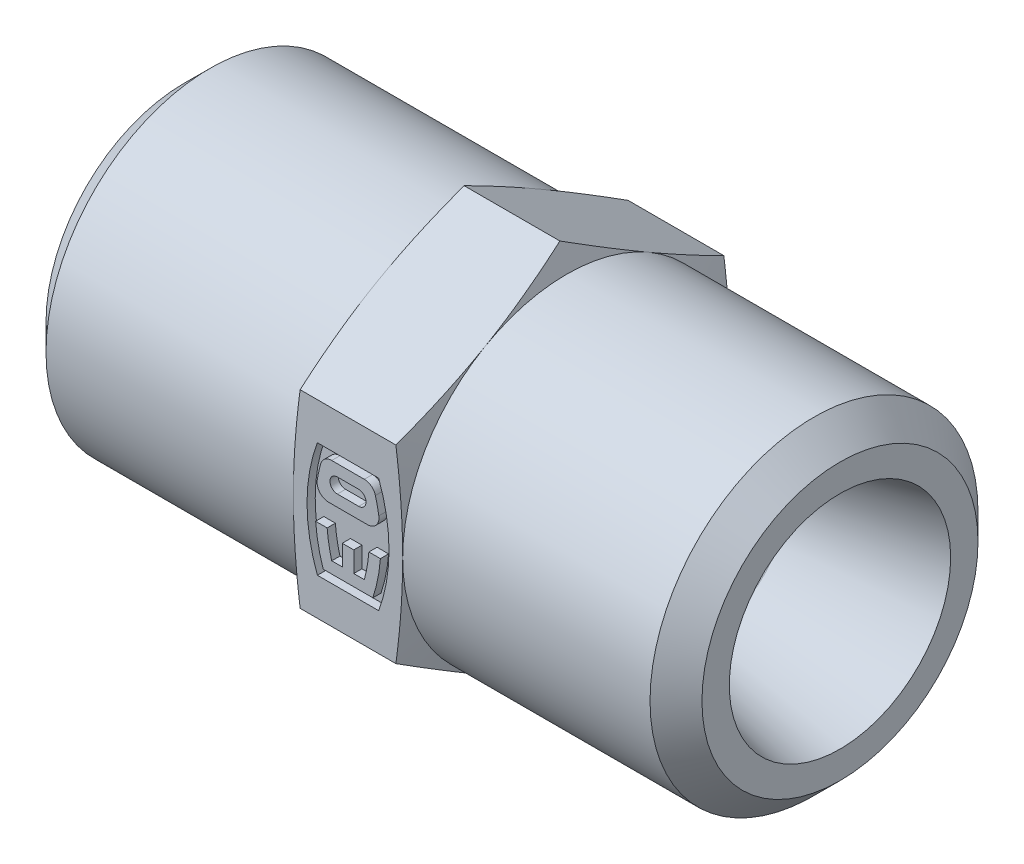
ISO-10303-21;
HEADER;
FILE_DESCRIPTION(('STEP AP214'),'2;1');
FILE_NAME('part.step','',(''),(''),'','','');
FILE_SCHEMA(('AUTOMOTIVE_DESIGN { 1 0 10303 214 1 1 1 1 }'));
ENDSEC;
DATA;
#1=APPLICATION_CONTEXT('core data for automotive mechanical design processes');
#2=APPLICATION_PROTOCOL_DEFINITION('international standard','automotive_design',2000,#1);
#3=PRODUCT_CONTEXT('',#1,'mechanical');
#4=PRODUCT('Part','Part','',(#3));
#5=PRODUCT_RELATED_PRODUCT_CATEGORY('part','',(#4));
#6=PRODUCT_DEFINITION_FORMATION('','',#4);
#7=PRODUCT_DEFINITION_CONTEXT('part definition',#1,'design');
#8=PRODUCT_DEFINITION('design','',#6,#7);
#9=PRODUCT_DEFINITION_SHAPE('','',#8);
#10=(LENGTH_UNIT() NAMED_UNIT(*) SI_UNIT(.MILLI.,.METRE.));
#11=(NAMED_UNIT(*) PLANE_ANGLE_UNIT() SI_UNIT($,.RADIAN.));
#12=(NAMED_UNIT(*) SI_UNIT($,.STERADIAN.) SOLID_ANGLE_UNIT());
#13=UNCERTAINTY_MEASURE_WITH_UNIT(LENGTH_MEASURE(1.E-05),#10,'distance_accuracy_value','');
#14=(GEOMETRIC_REPRESENTATION_CONTEXT(3) GLOBAL_UNCERTAINTY_ASSIGNED_CONTEXT((#13)) GLOBAL_UNIT_ASSIGNED_CONTEXT((#10,
#11,#12)) REPRESENTATION_CONTEXT('',''));
#15=CARTESIAN_POINT('',(0.,0.,0.));
#16=DIRECTION('',(0.,0.,1.));
#17=DIRECTION('',(1.,0.,0.));
#18=AXIS2_PLACEMENT_3D('',#15,#16,#17);
#19=CARTESIAN_POINT('',(0.,0.,5.7));
#20=DIRECTION('',(0.,0.,1.));
#21=DIRECTION('',(1.,0.,0.));
#22=AXIS2_PLACEMENT_3D('',#19,#20,#21);
#23=PLANE('',#22);
#24=CARTESIAN_POINT('',(-0.39,1.11,5.7));
#25=DIRECTION('',(0.,0.,1.));
#26=DIRECTION('',(1.,0.,0.));
#27=AXIS2_PLACEMENT_3D('',#24,#25,#26);
#28=CIRCLE('',#27,0.27);
#29=CARTESIAN_POINT('',(-0.39,1.38,5.7));
#30=VERTEX_POINT('',#29);
#31=CARTESIAN_POINT('',(-0.39,0.84,5.7));
#32=VERTEX_POINT('',#31);
#33=EDGE_CURVE('E850',#30,#32,#28,.T.);
#34=ORIENTED_EDGE('',*,*,#33,.T.);
#35=DIRECTION('',(1.,0.,0.));
#36=VECTOR('',#35,1.);
#37=CARTESIAN_POINT('',(0.39,0.84,5.7));
#38=LINE('',#37,#36);
#39=CARTESIAN_POINT('',(0.39,0.84,5.7));
#40=VERTEX_POINT('',#39);
#41=EDGE_CURVE('E270',#40,#32,#38,.F.);
#42=ORIENTED_EDGE('',*,*,#41,.F.);
#43=CARTESIAN_POINT('',(0.39,1.11,5.7));
#44=DIRECTION('',(0.,0.,1.));
#45=DIRECTION('',(1.,0.,0.));
#46=AXIS2_PLACEMENT_3D('',#43,#44,#45);
#47=CIRCLE('',#46,0.27);
#48=CARTESIAN_POINT('',(0.39,1.38,5.7));
#49=VERTEX_POINT('',#48);
#50=EDGE_CURVE('E20',#40,#49,#47,.T.);
#51=ORIENTED_EDGE('',*,*,#50,.T.);
#52=DIRECTION('',(1.,0.,0.));
#53=VECTOR('',#52,1.);
#54=CARTESIAN_POINT('',(-0.39,1.38,5.7));
#55=LINE('',#54,#53);
#56=EDGE_CURVE('E275',#30,#49,#55,.T.);
#57=ORIENTED_EDGE('',*,*,#56,.F.);
#58=EDGE_LOOP('',(#34,#42,#51,#57));
#59=FACE_BOUND('',#58,.T.);
#60=ADVANCED_FACE('F16',(#59),#23,.T.);
#61=CARTESIAN_POINT('',(-0.39,1.38,6.));
#62=DIRECTION('',(0.,-1.,0.));
#63=DIRECTION('',(0.,0.,-1.));
#64=AXIS2_PLACEMENT_3D('',#61,#62,#63);
#65=PLANE('',#64);
#66=DIRECTION('',(1.,0.,0.));
#67=VECTOR('',#66,1.);
#68=CARTESIAN_POINT('',(0.,1.38,6.));
#69=LINE('',#68,#67);
#70=CARTESIAN_POINT('',(-0.39,1.38,6.));
#71=VERTEX_POINT('',#70);
#72=CARTESIAN_POINT('',(0.39,1.38,6.));
#73=VERTEX_POINT('',#72);
#74=EDGE_CURVE('E864',#71,#73,#69,.T.);
#75=ORIENTED_EDGE('',*,*,#74,.F.);
#76=DIRECTION('',(0.,0.,1.));
#77=VECTOR('',#76,1.);
#78=CARTESIAN_POINT('',(-0.39,1.38,6.));
#79=LINE('',#78,#77);
#80=EDGE_CURVE('E281',#71,#30,#79,.F.);
#81=ORIENTED_EDGE('',*,*,#80,.T.);
#82=ORIENTED_EDGE('',*,*,#56,.T.);
#83=DIRECTION('',(0.,0.,1.));
#84=VECTOR('',#83,1.);
#85=CARTESIAN_POINT('',(0.39,1.38,6.));
#86=LINE('',#85,#84);
#87=EDGE_CURVE('E278',#49,#73,#86,.T.);
#88=ORIENTED_EDGE('',*,*,#87,.T.);
#89=EDGE_LOOP('',(#75,#81,#82,#88));
#90=FACE_BOUND('',#89,.T.);
#91=ADVANCED_FACE('F276',(#90),#65,.T.);
#92=CARTESIAN_POINT('',(0.39,1.11,6.));
#93=DIRECTION('',(0.,0.,1.));
#94=DIRECTION('',(1.,0.,0.));
#95=AXIS2_PLACEMENT_3D('',#92,#93,#94);
#96=CYLINDRICAL_SURFACE('',#95,0.27);
#97=DIRECTION('',(0.,0.,1.));
#98=VECTOR('',#97,1.);
#99=CARTESIAN_POINT('',(0.39,0.84,6.));
#100=LINE('',#99,#98);
#101=CARTESIAN_POINT('',(0.39,0.84,6.));
#102=VERTEX_POINT('',#101);
#103=EDGE_CURVE('E292',#102,#40,#100,.F.);
#104=ORIENTED_EDGE('',*,*,#103,.F.);
#105=CARTESIAN_POINT('',(0.39,1.11,6.));
#106=DIRECTION('',(0.,0.,1.));
#107=DIRECTION('',(1.,0.,0.));
#108=AXIS2_PLACEMENT_3D('',#105,#106,#107);
#109=CIRCLE('',#108,0.27);
#110=EDGE_CURVE('E288',#73,#102,#109,.F.);
#111=ORIENTED_EDGE('',*,*,#110,.F.);
#112=ORIENTED_EDGE('',*,*,#87,.F.);
#113=ORIENTED_EDGE('',*,*,#50,.F.);
#114=EDGE_LOOP('',(#104,#111,#112,#113));
#115=FACE_BOUND('',#114,.T.);
#116=ADVANCED_FACE('F286',(#115),#96,.F.);
#117=CARTESIAN_POINT('',(0.39,0.84,6.));
#118=DIRECTION('',(0.,1.,0.));
#119=DIRECTION('',(0.,0.,1.));
#120=AXIS2_PLACEMENT_3D('',#117,#118,#119);
#121=PLANE('',#120);
#122=DIRECTION('',(1.,0.,0.));
#123=VECTOR('',#122,1.);
#124=CARTESIAN_POINT('',(0.,0.84,6.));
#125=LINE('',#124,#123);
#126=CARTESIAN_POINT('',(-0.39,0.84,6.));
#127=VERTEX_POINT('',#126);
#128=EDGE_CURVE('E866',#102,#127,#125,.F.);
#129=ORIENTED_EDGE('',*,*,#128,.F.);
#130=ORIENTED_EDGE('',*,*,#103,.T.);
#131=ORIENTED_EDGE('',*,*,#41,.T.);
#132=DIRECTION('',(0.,0.,1.));
#133=VECTOR('',#132,1.);
#134=CARTESIAN_POINT('',(-0.39,0.84,6.));
#135=LINE('',#134,#133);
#136=EDGE_CURVE('E849',#32,#127,#135,.T.);
#137=ORIENTED_EDGE('',*,*,#136,.T.);
#138=EDGE_LOOP('',(#129,#130,#131,#137));
#139=FACE_BOUND('',#138,.T.);
#140=ADVANCED_FACE('F1123',(#139),#121,.T.);
#141=CARTESIAN_POINT('',(-0.39,1.11,6.));
#142=DIRECTION('',(0.,0.,1.));
#143=DIRECTION('',(1.,0.,0.));
#144=AXIS2_PLACEMENT_3D('',#141,#142,#143);
#145=CYLINDRICAL_SURFACE('',#144,0.27);
#146=ORIENTED_EDGE('',*,*,#80,.F.);
#147=CARTESIAN_POINT('',(-0.39,1.11,6.));
#148=DIRECTION('',(0.,0.,1.));
#149=DIRECTION('',(1.,0.,0.));
#150=AXIS2_PLACEMENT_3D('',#147,#148,#149);
#151=CIRCLE('',#150,0.27);
#152=EDGE_CURVE('E867',#127,#71,#151,.F.);
#153=ORIENTED_EDGE('',*,*,#152,.F.);
#154=ORIENTED_EDGE('',*,*,#136,.F.);
#155=ORIENTED_EDGE('',*,*,#33,.F.);
#156=EDGE_LOOP('',(#146,#153,#154,#155));
#157=FACE_BOUND('',#156,.T.);
#158=ADVANCED_FACE('F1125',(#157),#145,.F.);
#159=CARTESIAN_POINT('',(-6.03006919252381,0.,0.));
#160=DIRECTION('',(1.,0.,0.));
#161=DIRECTION('',(0.,0.,-1.));
#162=AXIS2_PLACEMENT_3D('',#159,#160,#161);
#163=CYLINDRICAL_SURFACE('',#162,3.);
#164=CARTESIAN_POINT('',(-5.,0.,0.));
#165=DIRECTION('',(1.,0.,0.));
#166=DIRECTION('',(0.,0.,-1.));
#167=AXIS2_PLACEMENT_3D('',#164,#165,#166);
#168=CIRCLE('',#167,3.);
#169=CARTESIAN_POINT('',(-5.,0.,-3.));
#170=VERTEX_POINT('',#169);
#171=EDGE_CURVE('E851',#170,#170,#168,.F.);
#172=ORIENTED_EDGE('',*,*,#171,.F.);
#173=EDGE_LOOP('',(#172));
#174=FACE_BOUND('',#173,.T.);
#175=CARTESIAN_POINT('',(-7.06013838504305,0.,0.));
#176=DIRECTION('',(-1.,0.,0.));
#177=DIRECTION('',(0.,1.,0.));
#178=AXIS2_PLACEMENT_3D('',#175,#176,#177);
#179=CIRCLE('',#178,3.00000000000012);
#180=CARTESIAN_POINT('',(-7.06013838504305,3.00000000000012,0.));
#181=VERTEX_POINT('',#180);
#182=EDGE_CURVE('E828',#181,#181,#179,.T.);
#183=ORIENTED_EDGE('',*,*,#182,.T.);
#184=EDGE_LOOP('',(#183));
#185=FACE_BOUND('',#184,.T.);
#186=ADVANCED_FACE('F1127',(#174,#185),#163,.F.);
#187=CARTESIAN_POINT('',(-5.,2.5,0.));
#188=DIRECTION('',(-1.,0.,0.));
#189=DIRECTION('',(0.,0.,1.));
#190=AXIS2_PLACEMENT_3D('',#187,#188,#189);
#191=PLANE('',#190);
#192=ORIENTED_EDGE('',*,*,#171,.T.);
#193=EDGE_LOOP('',(#192));
#194=FACE_BOUND('',#193,.T.);
#195=CARTESIAN_POINT('',(-5.,0.,0.));
#196=DIRECTION('',(1.,0.,0.));
#197=DIRECTION('',(0.,0.,-1.));
#198=AXIS2_PLACEMENT_3D('',#195,#196,#197);
#199=CIRCLE('',#198,2.);
#200=CARTESIAN_POINT('',(-5.,0.,-2.));
#201=VERTEX_POINT('',#200);
#202=EDGE_CURVE('E825',#201,#201,#199,.T.);
#203=ORIENTED_EDGE('',*,*,#202,.T.);
#204=EDGE_LOOP('',(#203));
#205=FACE_BOUND('',#204,.T.);
#206=ADVANCED_FACE('F1133',(#194,#205),#191,.T.);
#207=CARTESIAN_POINT('',(0.,0.,6.));
#208=DIRECTION('',(0.,0.,1.));
#209=DIRECTION('',(1.,0.,0.));
#210=AXIS2_PLACEMENT_3D('',#207,#208,#209);
#211=PLANE('',#210);
#212=ORIENTED_EDGE('',*,*,#128,.T.);
#213=ORIENTED_EDGE('',*,*,#152,.T.);
#214=ORIENTED_EDGE('',*,*,#74,.T.);
#215=ORIENTED_EDGE('',*,*,#110,.T.);
#216=EDGE_LOOP('',(#212,#213,#214,#215));
#217=FACE_BOUND('',#216,.T.);
#218=CARTESIAN_POINT('',(-0.596469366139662,1.38,6.));
#219=DIRECTION('',(0.,0.,1.));
#220=DIRECTION('',(1.,0.,0.));
#221=AXIS2_PLACEMENT_3D('',#218,#219,#220);
#222=CIRCLE('',#221,0.42);
#223=CARTESIAN_POINT('',(-1.00187033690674,1.48977273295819,6.));
#224=VERTEX_POINT('',#223);
#225=CARTESIAN_POINT('',(-0.596469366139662,1.8,6.));
#226=VERTEX_POINT('',#225);
#227=EDGE_CURVE('E809',#224,#226,#222,.F.);
#228=ORIENTED_EDGE('',*,*,#227,.F.);
#229=CARTESIAN_POINT('',(4.5,0.,6.));
#230=DIRECTION('',(0.,0.,1.));
#231=DIRECTION('',(1.,0.,0.));
#232=AXIS2_PLACEMENT_3D('',#229,#230,#231);
#233=CIRCLE('',#232,5.7);
#234=CARTESIAN_POINT('',(-1.1274044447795,0.906818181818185,6.));
#235=VERTEX_POINT('',#234);
#236=EDGE_CURVE('E813',#235,#224,#233,.F.);
#237=ORIENTED_EDGE('',*,*,#236,.F.);
#238=CARTESIAN_POINT('',(-0.712753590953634,0.84,6.));
#239=DIRECTION('',(0.,0.,1.));
#240=DIRECTION('',(1.,0.,0.));
#241=AXIS2_PLACEMENT_3D('',#238,#239,#240);
#242=CIRCLE('',#241,0.42);
#243=CARTESIAN_POINT('',(-0.712753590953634,0.42,6.));
#244=VERTEX_POINT('',#243);
#245=EDGE_CURVE('E817',#244,#235,#242,.F.);
#246=ORIENTED_EDGE('',*,*,#245,.F.);
#247=DIRECTION('',(1.,0.,0.));
#248=VECTOR('',#247,1.);
#249=CARTESIAN_POINT('',(-0.712753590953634,0.42,6.));
#250=LINE('',#249,#248);
#251=CARTESIAN_POINT('',(0.712753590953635,0.42,6.));
#252=VERTEX_POINT('',#251);
#253=EDGE_CURVE('E821',#252,#244,#250,.F.);
#254=ORIENTED_EDGE('',*,*,#253,.F.);
#255=CARTESIAN_POINT('',(0.712753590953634,0.84,6.));
#256=DIRECTION('',(0.,0.,1.));
#257=DIRECTION('',(1.,0.,0.));
#258=AXIS2_PLACEMENT_3D('',#255,#256,#257);
#259=CIRCLE('',#258,0.42);
#260=CARTESIAN_POINT('',(1.12740444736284,0.906818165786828,6.));
#261=VERTEX_POINT('',#260);
#262=EDGE_CURVE('E854',#252,#261,#259,.T.);
#263=ORIENTED_EDGE('',*,*,#262,.T.);
#264=CARTESIAN_POINT('',(-4.50000000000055,0.,6.));
#265=DIRECTION('',(0.,0.,1.));
#266=DIRECTION('',(1.,0.,0.));
#267=AXIS2_PLACEMENT_3D('',#264,#265,#266);
#268=CIRCLE('',#267,5.70000000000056);
#269=CARTESIAN_POINT('',(1.00187033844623,1.48977272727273,6.));
#270=VERTEX_POINT('',#269);
#271=EDGE_CURVE('E859',#261,#270,#268,.T.);
#272=ORIENTED_EDGE('',*,*,#271,.T.);
#273=CARTESIAN_POINT('',(0.59646936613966,1.38,6.));
#274=DIRECTION('',(0.,0.,1.));
#275=DIRECTION('',(1.,0.,0.));
#276=AXIS2_PLACEMENT_3D('',#273,#274,#275);
#277=CIRCLE('',#276,0.42);
#278=CARTESIAN_POINT('',(0.596469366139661,1.8,6.));
#279=VERTEX_POINT('',#278);
#280=EDGE_CURVE('E862',#270,#279,#277,.T.);
#281=ORIENTED_EDGE('',*,*,#280,.T.);
#282=DIRECTION('',(1.,0.,0.));
#283=VECTOR('',#282,1.);
#284=CARTESIAN_POINT('',(0.596469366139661,1.8,6.));
#285=LINE('',#284,#283);
#286=EDGE_CURVE('E805',#226,#279,#285,.T.);
#287=ORIENTED_EDGE('',*,*,#286,.F.);
#288=EDGE_LOOP('',(#228,#237,#246,#254,#263,#272,#281,#287));
#289=FACE_BOUND('',#288,.T.);
#290=ADVANCED_FACE('F1119',(#217,#289),#211,.T.);
#291=CARTESIAN_POINT('',(0.,0.,6.));
#292=DIRECTION('',(0.,0.,1.));
#293=DIRECTION('',(1.,0.,0.));
#294=AXIS2_PLACEMENT_3D('',#291,#292,#293);
#295=PLANE('',#294);
#296=CARTESIAN_POINT('',(4.5,0.,6.));
#297=DIRECTION('',(0.,0.,1.));
#298=DIRECTION('',(1.,0.,0.));
#299=AXIS2_PLACEMENT_3D('',#296,#297,#298);
#300=CIRCLE('',#299,5.28);
#301=CARTESIAN_POINT('',(-0.59646936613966,-1.38,6.));
#302=VERTEX_POINT('',#301);
#303=CARTESIAN_POINT('',(-0.76326894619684,-0.42,6.));
#304=VERTEX_POINT('',#303);
#305=EDGE_CURVE('E879',#302,#304,#300,.F.);
#306=ORIENTED_EDGE('',*,*,#305,.T.);
#307=DIRECTION('',(1.,0.,0.));
#308=VECTOR('',#307,1.);
#309=CARTESIAN_POINT('',(0.,-0.42,6.));
#310=LINE('',#309,#308);
#311=CARTESIAN_POINT('',(-1.18450525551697,-0.42,6.));
#312=VERTEX_POINT('',#311);
#313=EDGE_CURVE('E831',#304,#312,#310,.F.);
#314=ORIENTED_EDGE('',*,*,#313,.T.);
#315=CARTESIAN_POINT('',(4.5,0.,6.));
#316=DIRECTION('',(0.,0.,1.));
#317=DIRECTION('',(1.,0.,0.));
#318=AXIS2_PLACEMENT_3D('',#315,#316,#317);
#319=CIRCLE('',#318,5.7);
#320=CARTESIAN_POINT('',(-0.908326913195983,-1.8,6.));
#321=VERTEX_POINT('',#320);
#322=EDGE_CURVE('E870',#312,#321,#319,.T.);
#323=ORIENTED_EDGE('',*,*,#322,.T.);
#324=DIRECTION('',(1.,0.,0.));
#325=VECTOR('',#324,1.);
#326=CARTESIAN_POINT('',(-0.908326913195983,-1.8,6.));
#327=LINE('',#326,#325);
#328=CARTESIAN_POINT('',(0.908326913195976,-1.8,6.));
#329=VERTEX_POINT('',#328);
#330=EDGE_CURVE('E792',#329,#321,#327,.F.);
#331=ORIENTED_EDGE('',*,*,#330,.F.);
#332=CARTESIAN_POINT('',(-4.50000000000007,0.,6.));
#333=DIRECTION('',(0.,0.,1.));
#334=DIRECTION('',(1.,0.,0.));
#335=AXIS2_PLACEMENT_3D('',#332,#333,#334);
#336=CIRCLE('',#335,5.7);
#337=CARTESIAN_POINT('',(1.18450525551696,-0.42,6.));
#338=VERTEX_POINT('',#337);
#339=EDGE_CURVE('E872',#329,#338,#336,.T.);
#340=ORIENTED_EDGE('',*,*,#339,.T.);
#341=DIRECTION('',(1.,0.,0.));
#342=VECTOR('',#341,1.);
#343=CARTESIAN_POINT('',(0.,-0.42,6.));
#344=LINE('',#343,#342);
#345=CARTESIAN_POINT('',(0.763268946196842,-0.42,6.));
#346=VERTEX_POINT('',#345);
#347=EDGE_CURVE('E875',#338,#346,#344,.F.);
#348=ORIENTED_EDGE('',*,*,#347,.T.);
#349=CARTESIAN_POINT('',(-4.5,0.,6.));
#350=DIRECTION('',(0.,0.,1.));
#351=DIRECTION('',(1.,0.,0.));
#352=AXIS2_PLACEMENT_3D('',#349,#350,#351);
#353=CIRCLE('',#352,5.28);
#354=CARTESIAN_POINT('',(0.596469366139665,-1.38,6.));
#355=VERTEX_POINT('',#354);
#356=EDGE_CURVE('E876',#346,#355,#353,.F.);
#357=ORIENTED_EDGE('',*,*,#356,.T.);
#358=DIRECTION('',(1.,0.,0.));
#359=VECTOR('',#358,1.);
#360=CARTESIAN_POINT('',(0.,-1.38,6.));
#361=LINE('',#360,#359);
#362=CARTESIAN_POINT('',(0.21,-1.38,6.));
#363=VERTEX_POINT('',#362);
#364=EDGE_CURVE('E846',#355,#363,#361,.F.);
#365=ORIENTED_EDGE('',*,*,#364,.T.);
#366=DIRECTION('',(0.,1.,0.));
#367=VECTOR('',#366,1.);
#368=CARTESIAN_POINT('',(0.21,0.,6.));
#369=LINE('',#368,#367);
#370=CARTESIAN_POINT('',(0.21,-0.63,6.));
#371=VERTEX_POINT('',#370);
#372=EDGE_CURVE('E841',#363,#371,#369,.T.);
#373=ORIENTED_EDGE('',*,*,#372,.T.);
#374=DIRECTION('',(1.,0.,0.));
#375=VECTOR('',#374,1.);
#376=CARTESIAN_POINT('',(0.,-0.63,6.));
#377=LINE('',#376,#375);
#378=CARTESIAN_POINT('',(-0.21,-0.63,6.));
#379=VERTEX_POINT('',#378);
#380=EDGE_CURVE('E836',#371,#379,#377,.F.);
#381=ORIENTED_EDGE('',*,*,#380,.T.);
#382=DIRECTION('',(0.,1.,0.));
#383=VECTOR('',#382,1.);
#384=CARTESIAN_POINT('',(-0.21,0.,6.));
#385=LINE('',#384,#383);
#386=CARTESIAN_POINT('',(-0.21,-1.38,6.));
#387=VERTEX_POINT('',#386);
#388=EDGE_CURVE('E832',#379,#387,#385,.F.);
#389=ORIENTED_EDGE('',*,*,#388,.T.);
#390=DIRECTION('',(1.,0.,0.));
#391=VECTOR('',#390,1.);
#392=CARTESIAN_POINT('',(0.,-1.38,6.));
#393=LINE('',#392,#391);
#394=EDGE_CURVE('E835',#387,#302,#393,.F.);
#395=ORIENTED_EDGE('',*,*,#394,.T.);
#396=EDGE_LOOP('',(#306,#314,#323,#331,#340,#348,#357,#365,#373,#381,#389,#395));
#397=FACE_BOUND('',#396,.T.);
#398=ADVANCED_FACE('F1144',(#397),#295,.T.);
#399=CARTESIAN_POINT('',(-11.9999999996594,0.,0.));
#400=DIRECTION('',(-1.,0.,0.));
#401=DIRECTION('',(0.,0.,1.));
#402=AXIS2_PLACEMENT_3D('',#399,#400,#401);
#403=CONICAL_SURFACE('',#402,4.04999999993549,0.209439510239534);
#404=ORIENTED_EDGE('',*,*,#182,.F.);
#405=EDGE_LOOP('',(#404));
#406=FACE_BOUND('',#405,.T.);
#407=CARTESIAN_POINT('',(-11.9999999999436,0.,0.));
#408=DIRECTION('',(-1.,0.,0.));
#409=DIRECTION('',(0.,0.,1.));
#410=AXIS2_PLACEMENT_3D('',#407,#408,#409);
#411=CIRCLE('',#410,4.04999999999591);
#412=CARTESIAN_POINT('',(-11.9999999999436,0.,4.04999999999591));
#413=VERTEX_POINT('',#412);
#414=EDGE_CURVE('E887',#413,#413,#411,.F.);
#415=ORIENTED_EDGE('',*,*,#414,.F.);
#416=EDGE_LOOP('',(#415));
#417=FACE_BOUND('',#416,.T.);
#418=ADVANCED_FACE('F1147',(#406,#417),#403,.F.);
#419=CARTESIAN_POINT('',(0.,0.,0.));
#420=DIRECTION('',(1.,0.,0.));
#421=DIRECTION('',(0.,0.,-1.));
#422=AXIS2_PLACEMENT_3D('',#419,#420,#421);
#423=CYLINDRICAL_SURFACE('',#422,2.);
#424=CARTESIAN_POINT('',(5.,0.,0.));
#425=DIRECTION('',(1.,0.,0.));
#426=DIRECTION('',(0.,0.,-1.));
#427=AXIS2_PLACEMENT_3D('',#424,#425,#426);
#428=CIRCLE('',#427,2.);
#429=CARTESIAN_POINT('',(5.,0.,-2.));
#430=VERTEX_POINT('',#429);
#431=EDGE_CURVE('E890',#430,#430,#428,.F.);
#432=ORIENTED_EDGE('',*,*,#431,.F.);
#433=EDGE_LOOP('',(#432));
#434=FACE_BOUND('',#433,.T.);
#435=ORIENTED_EDGE('',*,*,#202,.F.);
#436=EDGE_LOOP('',(#435));
#437=FACE_BOUND('',#436,.T.);
#438=ADVANCED_FACE('F1151',(#434,#437),#423,.F.);
#439=CARTESIAN_POINT('',(-0.712753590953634,0.42,6.));
#440=DIRECTION('',(0.,-1.,0.));
#441=DIRECTION('',(1.,0.,0.));
#442=AXIS2_PLACEMENT_3D('',#439,#440,#441);
#443=PLANE('',#442);
#444=ORIENTED_EDGE('',*,*,#253,.T.);
#445=DIRECTION('',(0.,0.,1.));
#446=VECTOR('',#445,1.);
#447=CARTESIAN_POINT('',(-0.712753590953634,0.42,6.));
#448=LINE('',#447,#446);
#449=CARTESIAN_POINT('',(-0.712753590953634,0.42,5.7));
#450=VERTEX_POINT('',#449);
#451=EDGE_CURVE('E818',#450,#244,#448,.T.);
#452=ORIENTED_EDGE('',*,*,#451,.F.);
#453=DIRECTION('',(1.,0.,0.));
#454=VECTOR('',#453,1.);
#455=CARTESIAN_POINT('',(0.,0.42,5.7));
#456=LINE('',#455,#454);
#457=CARTESIAN_POINT('',(0.712753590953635,0.42,5.7));
#458=VERTEX_POINT('',#457);
#459=EDGE_CURVE('E893',#458,#450,#456,.F.);
#460=ORIENTED_EDGE('',*,*,#459,.F.);
#461=DIRECTION('',(0.,0.,1.));
#462=VECTOR('',#461,1.);
#463=CARTESIAN_POINT('',(0.712753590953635,0.42,6.));
#464=LINE('',#463,#462);
#465=EDGE_CURVE('E793',#252,#458,#464,.F.);
#466=ORIENTED_EDGE('',*,*,#465,.F.);
#467=EDGE_LOOP('',(#444,#452,#460,#466));
#468=FACE_BOUND('',#467,.T.);
#469=ADVANCED_FACE('F1155',(#468),#443,.T.);
#470=CARTESIAN_POINT('',(-0.712753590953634,0.84,6.));
#471=DIRECTION('',(0.,0.,1.));
#472=DIRECTION('',(1.,0.,0.));
#473=AXIS2_PLACEMENT_3D('',#470,#471,#472);
#474=CYLINDRICAL_SURFACE('',#473,0.42);
#475=ORIENTED_EDGE('',*,*,#245,.T.);
#476=DIRECTION('',(0.,0.,1.));
#477=VECTOR('',#476,1.);
#478=CARTESIAN_POINT('',(-1.1274044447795,0.906818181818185,6.));
#479=LINE('',#478,#477);
#480=CARTESIAN_POINT('',(-1.1274044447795,0.906818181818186,5.7));
#481=VERTEX_POINT('',#480);
#482=EDGE_CURVE('E814',#481,#235,#479,.T.);
#483=ORIENTED_EDGE('',*,*,#482,.F.);
#484=CARTESIAN_POINT('',(-0.712753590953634,0.84,5.7));
#485=DIRECTION('',(0.,0.,1.));
#486=DIRECTION('',(1.,0.,0.));
#487=AXIS2_PLACEMENT_3D('',#484,#485,#486);
#488=CIRCLE('',#487,0.42);
#489=EDGE_CURVE('E894',#450,#481,#488,.F.);
#490=ORIENTED_EDGE('',*,*,#489,.F.);
#491=ORIENTED_EDGE('',*,*,#451,.T.);
#492=EDGE_LOOP('',(#475,#483,#490,#491));
#493=FACE_BOUND('',#492,.T.);
#494=ADVANCED_FACE('F1159',(#493),#474,.T.);
#495=CARTESIAN_POINT('',(4.5,0.,6.));
#496=DIRECTION('',(0.,0.,1.));
#497=DIRECTION('',(1.,0.,0.));
#498=AXIS2_PLACEMENT_3D('',#495,#496,#497);
#499=CYLINDRICAL_SURFACE('',#498,5.7);
#500=ORIENTED_EDGE('',*,*,#236,.T.);
#501=DIRECTION('',(0.,0.,1.));
#502=VECTOR('',#501,1.);
#503=CARTESIAN_POINT('',(-1.00187033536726,1.48977273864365,6.));
#504=LINE('',#503,#502);
#505=CARTESIAN_POINT('',(-1.00187033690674,1.48977273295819,5.7));
#506=VERTEX_POINT('',#505);
#507=EDGE_CURVE('E810',#506,#224,#504,.T.);
#508=ORIENTED_EDGE('',*,*,#507,.F.);
#509=CARTESIAN_POINT('',(4.5,0.,5.7));
#510=DIRECTION('',(0.,0.,1.));
#511=DIRECTION('',(1.,0.,0.));
#512=AXIS2_PLACEMENT_3D('',#509,#510,#511);
#513=CIRCLE('',#512,5.7);
#514=EDGE_CURVE('E897',#481,#506,#513,.F.);
#515=ORIENTED_EDGE('',*,*,#514,.F.);
#516=ORIENTED_EDGE('',*,*,#482,.T.);
#517=EDGE_LOOP('',(#500,#508,#515,#516));
#518=FACE_BOUND('',#517,.T.);
#519=ADVANCED_FACE('F1163',(#518),#499,.T.);
#520=CARTESIAN_POINT('',(-0.596469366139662,1.38,6.));
#521=DIRECTION('',(0.,0.,1.));
#522=DIRECTION('',(1.,0.,0.));
#523=AXIS2_PLACEMENT_3D('',#520,#521,#522);
#524=CYLINDRICAL_SURFACE('',#523,0.42);
#525=ORIENTED_EDGE('',*,*,#227,.T.);
#526=DIRECTION('',(0.,0.,1.));
#527=VECTOR('',#526,1.);
#528=CARTESIAN_POINT('',(-0.596469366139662,1.8,6.));
#529=LINE('',#528,#527);
#530=CARTESIAN_POINT('',(-0.596469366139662,1.8,5.7));
#531=VERTEX_POINT('',#530);
#532=EDGE_CURVE('E806',#531,#226,#529,.T.);
#533=ORIENTED_EDGE('',*,*,#532,.F.);
#534=CARTESIAN_POINT('',(-0.596469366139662,1.38,5.7));
#535=DIRECTION('',(0.,0.,1.));
#536=DIRECTION('',(1.,0.,0.));
#537=AXIS2_PLACEMENT_3D('',#534,#535,#536);
#538=CIRCLE('',#537,0.42);
#539=EDGE_CURVE('E900',#506,#531,#538,.F.);
#540=ORIENTED_EDGE('',*,*,#539,.F.);
#541=ORIENTED_EDGE('',*,*,#507,.T.);
#542=EDGE_LOOP('',(#525,#533,#540,#541));
#543=FACE_BOUND('',#542,.T.);
#544=ADVANCED_FACE('F1167',(#543),#524,.T.);
#545=CARTESIAN_POINT('',(0.596469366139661,1.8,6.));
#546=DIRECTION('',(0.,1.,0.));
#547=DIRECTION('',(0.,0.,1.));
#548=AXIS2_PLACEMENT_3D('',#545,#546,#547);
#549=PLANE('',#548);
#550=ORIENTED_EDGE('',*,*,#286,.T.);
#551=DIRECTION('',(0.,0.,1.));
#552=VECTOR('',#551,1.);
#553=CARTESIAN_POINT('',(0.596469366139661,1.8,6.));
#554=LINE('',#553,#552);
#555=CARTESIAN_POINT('',(0.596469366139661,1.8,5.7));
#556=VERTEX_POINT('',#555);
#557=EDGE_CURVE('E802',#556,#279,#554,.T.);
#558=ORIENTED_EDGE('',*,*,#557,.F.);
#559=DIRECTION('',(1.,0.,0.));
#560=VECTOR('',#559,1.);
#561=CARTESIAN_POINT('',(0.,1.8,5.7));
#562=LINE('',#561,#560);
#563=EDGE_CURVE('E903',#531,#556,#562,.T.);
#564=ORIENTED_EDGE('',*,*,#563,.F.);
#565=ORIENTED_EDGE('',*,*,#532,.T.);
#566=EDGE_LOOP('',(#550,#558,#564,#565));
#567=FACE_BOUND('',#566,.T.);
#568=ADVANCED_FACE('F1171',(#567),#549,.T.);
#569=CARTESIAN_POINT('',(0.59646936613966,1.38,6.));
#570=DIRECTION('',(0.,0.,1.));
#571=DIRECTION('',(1.,0.,0.));
#572=AXIS2_PLACEMENT_3D('',#569,#570,#571);
#573=CYLINDRICAL_SURFACE('',#572,0.42);
#574=ORIENTED_EDGE('',*,*,#280,.F.);
#575=DIRECTION('',(0.,0.,1.));
#576=VECTOR('',#575,1.);
#577=CARTESIAN_POINT('',(1.00187033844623,1.48977272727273,6.));
#578=LINE('',#577,#576);
#579=CARTESIAN_POINT('',(1.00187033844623,1.48977272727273,5.7));
#580=VERTEX_POINT('',#579);
#581=EDGE_CURVE('E799',#580,#270,#578,.T.);
#582=ORIENTED_EDGE('',*,*,#581,.F.);
#583=CARTESIAN_POINT('',(0.59646936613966,1.38,5.7));
#584=DIRECTION('',(0.,0.,1.));
#585=DIRECTION('',(1.,0.,0.));
#586=AXIS2_PLACEMENT_3D('',#583,#584,#585);
#587=CIRCLE('',#586,0.42);
#588=EDGE_CURVE('E904',#556,#580,#587,.F.);
#589=ORIENTED_EDGE('',*,*,#588,.F.);
#590=ORIENTED_EDGE('',*,*,#557,.T.);
#591=EDGE_LOOP('',(#574,#582,#589,#590));
#592=FACE_BOUND('',#591,.T.);
#593=ADVANCED_FACE('F1175',(#592),#573,.T.);
#594=CARTESIAN_POINT('',(-4.50000000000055,0.,6.));
#595=DIRECTION('',(0.,0.,1.));
#596=DIRECTION('',(1.,0.,0.));
#597=AXIS2_PLACEMENT_3D('',#594,#595,#596);
#598=CYLINDRICAL_SURFACE('',#597,5.70000000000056);
#599=ORIENTED_EDGE('',*,*,#271,.F.);
#600=DIRECTION('',(0.,0.,1.));
#601=VECTOR('',#600,1.);
#602=CARTESIAN_POINT('',(1.12740444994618,0.906818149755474,6.));
#603=LINE('',#602,#601);
#604=CARTESIAN_POINT('',(1.12740444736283,0.906818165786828,5.7));
#605=VERTEX_POINT('',#604);
#606=EDGE_CURVE('E796',#605,#261,#603,.T.);
#607=ORIENTED_EDGE('',*,*,#606,.F.);
#608=CARTESIAN_POINT('',(-4.50000000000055,0.,5.7));
#609=DIRECTION('',(0.,0.,1.));
#610=DIRECTION('',(1.,0.,0.));
#611=AXIS2_PLACEMENT_3D('',#608,#609,#610);
#612=CIRCLE('',#611,5.70000000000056);
#613=EDGE_CURVE('E907',#580,#605,#612,.F.);
#614=ORIENTED_EDGE('',*,*,#613,.F.);
#615=ORIENTED_EDGE('',*,*,#581,.T.);
#616=EDGE_LOOP('',(#599,#607,#614,#615));
#617=FACE_BOUND('',#616,.T.);
#618=ADVANCED_FACE('F1179',(#617),#598,.T.);
#619=CARTESIAN_POINT('',(0.712753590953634,0.84,6.));
#620=DIRECTION('',(0.,0.,1.));
#621=DIRECTION('',(1.,0.,0.));
#622=AXIS2_PLACEMENT_3D('',#619,#620,#621);
#623=CYLINDRICAL_SURFACE('',#622,0.42);
#624=ORIENTED_EDGE('',*,*,#262,.F.);
#625=ORIENTED_EDGE('',*,*,#465,.T.);
#626=CARTESIAN_POINT('',(0.712753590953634,0.84,5.7));
#627=DIRECTION('',(0.,0.,1.));
#628=DIRECTION('',(1.,0.,0.));
#629=AXIS2_PLACEMENT_3D('',#626,#627,#628);
#630=CIRCLE('',#629,0.42);
#631=EDGE_CURVE('E910',#605,#458,#630,.F.);
#632=ORIENTED_EDGE('',*,*,#631,.F.);
#633=ORIENTED_EDGE('',*,*,#606,.T.);
#634=EDGE_LOOP('',(#624,#625,#632,#633));
#635=FACE_BOUND('',#634,.T.);
#636=ADVANCED_FACE('F1183',(#635),#623,.T.);
#637=CARTESIAN_POINT('',(-0.908326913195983,-1.8,6.));
#638=DIRECTION('',(0.,-1.,0.));
#639=DIRECTION('',(0.,0.,-1.));
#640=AXIS2_PLACEMENT_3D('',#637,#638,#639);
#641=PLANE('',#640);
#642=ORIENTED_EDGE('',*,*,#330,.T.);
#643=DIRECTION('',(0.,0.,1.));
#644=VECTOR('',#643,1.);
#645=CARTESIAN_POINT('',(-0.908326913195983,-1.8,6.));
#646=LINE('',#645,#644);
#647=CARTESIAN_POINT('',(-0.908326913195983,-1.8,5.7));
#648=VERTEX_POINT('',#647);
#649=EDGE_CURVE('E789',#648,#321,#646,.T.);
#650=ORIENTED_EDGE('',*,*,#649,.F.);
#651=DIRECTION('',(1.,0.,0.));
#652=VECTOR('',#651,1.);
#653=CARTESIAN_POINT('',(0.,-1.8,5.7));
#654=LINE('',#653,#652);
#655=CARTESIAN_POINT('',(0.908326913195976,-1.8,5.7));
#656=VERTEX_POINT('',#655);
#657=EDGE_CURVE('E913',#656,#648,#654,.F.);
#658=ORIENTED_EDGE('',*,*,#657,.F.);
#659=DIRECTION('',(0.,0.,1.));
#660=VECTOR('',#659,1.);
#661=CARTESIAN_POINT('',(0.908326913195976,-1.8,6.));
#662=LINE('',#661,#660);
#663=EDGE_CURVE('E732',#329,#656,#662,.F.);
#664=ORIENTED_EDGE('',*,*,#663,.F.);
#665=EDGE_LOOP('',(#642,#650,#658,#664));
#666=FACE_BOUND('',#665,.T.);
#667=ADVANCED_FACE('F1187',(#666),#641,.T.);
#668=CARTESIAN_POINT('',(4.5,0.,6.));
#669=DIRECTION('',(0.,0.,1.));
#670=DIRECTION('',(1.,0.,0.));
#671=AXIS2_PLACEMENT_3D('',#668,#669,#670);
#672=CYLINDRICAL_SURFACE('',#671,5.7);
#673=ORIENTED_EDGE('',*,*,#322,.F.);
#674=DIRECTION('',(0.,0.,1.));
#675=VECTOR('',#674,1.);
#676=CARTESIAN_POINT('',(-1.18450525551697,-0.42,6.));
#677=LINE('',#676,#675);
#678=CARTESIAN_POINT('',(-1.18450525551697,-0.42,5.7));
#679=VERTEX_POINT('',#678);
#680=EDGE_CURVE('E786',#679,#312,#677,.T.);
#681=ORIENTED_EDGE('',*,*,#680,.F.);
#682=CARTESIAN_POINT('',(4.5,0.,5.7));
#683=DIRECTION('',(0.,0.,1.));
#684=DIRECTION('',(1.,0.,0.));
#685=AXIS2_PLACEMENT_3D('',#682,#683,#684);
#686=CIRCLE('',#685,5.7);
#687=EDGE_CURVE('E914',#648,#679,#686,.F.);
#688=ORIENTED_EDGE('',*,*,#687,.F.);
#689=ORIENTED_EDGE('',*,*,#649,.T.);
#690=EDGE_LOOP('',(#673,#681,#688,#689));
#691=FACE_BOUND('',#690,.T.);
#692=ADVANCED_FACE('F1191',(#691),#672,.T.);
#693=CARTESIAN_POINT('',(-0.763268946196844,-0.42,6.));
#694=DIRECTION('',(0.,1.,0.));
#695=DIRECTION('',(0.,0.,1.));
#696=AXIS2_PLACEMENT_3D('',#693,#694,#695);
#697=PLANE('',#696);
#698=ORIENTED_EDGE('',*,*,#313,.F.);
#699=DIRECTION('',(0.,0.,1.));
#700=VECTOR('',#699,1.);
#701=CARTESIAN_POINT('',(-0.76326894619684,-0.42,6.));
#702=LINE('',#701,#700);
#703=CARTESIAN_POINT('',(-0.76326894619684,-0.42,5.7));
#704=VERTEX_POINT('',#703);
#705=EDGE_CURVE('E784',#304,#704,#702,.F.);
#706=ORIENTED_EDGE('',*,*,#705,.T.);
#707=DIRECTION('',(1.,0.,0.));
#708=VECTOR('',#707,1.);
#709=CARTESIAN_POINT('',(0.,-0.42,5.7));
#710=LINE('',#709,#708);
#711=EDGE_CURVE('E917',#679,#704,#710,.T.);
#712=ORIENTED_EDGE('',*,*,#711,.F.);
#713=ORIENTED_EDGE('',*,*,#680,.T.);
#714=EDGE_LOOP('',(#698,#706,#712,#713));
#715=FACE_BOUND('',#714,.T.);
#716=ADVANCED_FACE('F1195',(#715),#697,.T.);
#717=CARTESIAN_POINT('',(4.5,0.,6.));
#718=DIRECTION('',(0.,0.,1.));
#719=DIRECTION('',(1.,0.,0.));
#720=AXIS2_PLACEMENT_3D('',#717,#718,#719);
#721=CYLINDRICAL_SURFACE('',#720,5.28);
#722=ORIENTED_EDGE('',*,*,#705,.F.);
#723=ORIENTED_EDGE('',*,*,#305,.F.);
#724=DIRECTION('',(0.,0.,1.));
#725=VECTOR('',#724,1.);
#726=CARTESIAN_POINT('',(-0.596469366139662,-1.38,6.));
#727=LINE('',#726,#725);
#728=CARTESIAN_POINT('',(-0.59646936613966,-1.38,5.7));
#729=VERTEX_POINT('',#728);
#730=EDGE_CURVE('E779',#729,#302,#727,.T.);
#731=ORIENTED_EDGE('',*,*,#730,.F.);
#732=CARTESIAN_POINT('',(4.5,0.,5.7));
#733=DIRECTION('',(0.,0.,1.));
#734=DIRECTION('',(1.,0.,0.));
#735=AXIS2_PLACEMENT_3D('',#732,#733,#734);
#736=CIRCLE('',#735,5.28);
#737=EDGE_CURVE('E918',#704,#729,#736,.T.);
#738=ORIENTED_EDGE('',*,*,#737,.F.);
#739=EDGE_LOOP('',(#722,#723,#731,#738));
#740=FACE_BOUND('',#739,.T.);
#741=ADVANCED_FACE('F1199',(#740),#721,.F.);
#742=CARTESIAN_POINT('',(-0.21,-1.38,6.));
#743=DIRECTION('',(0.,1.,0.));
#744=DIRECTION('',(0.,0.,1.));
#745=AXIS2_PLACEMENT_3D('',#742,#743,#744);
#746=PLANE('',#745);
#747=ORIENTED_EDGE('',*,*,#394,.F.);
#748=DIRECTION('',(0.,0.,1.));
#749=VECTOR('',#748,1.);
#750=CARTESIAN_POINT('',(-0.21,-1.38,6.));
#751=LINE('',#750,#749);
#752=CARTESIAN_POINT('',(-0.21,-1.38,5.7));
#753=VERTEX_POINT('',#752);
#754=EDGE_CURVE('E769',#753,#387,#751,.T.);
#755=ORIENTED_EDGE('',*,*,#754,.F.);
#756=DIRECTION('',(1.,0.,0.));
#757=VECTOR('',#756,1.);
#758=CARTESIAN_POINT('',(0.,-1.38,5.7));
#759=LINE('',#758,#757);
#760=EDGE_CURVE('E774',#729,#753,#759,.T.);
#761=ORIENTED_EDGE('',*,*,#760,.F.);
#762=ORIENTED_EDGE('',*,*,#730,.T.);
#763=EDGE_LOOP('',(#747,#755,#761,#762));
#764=FACE_BOUND('',#763,.T.);
#765=ADVANCED_FACE('F1203',(#764),#746,.T.);
#766=CARTESIAN_POINT('',(-0.21,-0.63,6.));
#767=DIRECTION('',(-1.,0.,0.));
#768=DIRECTION('',(0.,-1.,0.));
#769=AXIS2_PLACEMENT_3D('',#766,#767,#768);
#770=PLANE('',#769);
#771=ORIENTED_EDGE('',*,*,#388,.F.);
#772=DIRECTION('',(0.,0.,1.));
#773=VECTOR('',#772,1.);
#774=CARTESIAN_POINT('',(-0.21,-0.63,6.));
#775=LINE('',#774,#773);
#776=CARTESIAN_POINT('',(-0.21,-0.63,5.7));
#777=VERTEX_POINT('',#776);
#778=EDGE_CURVE('E759',#777,#379,#775,.T.);
#779=ORIENTED_EDGE('',*,*,#778,.F.);
#780=DIRECTION('',(0.,1.,0.));
#781=VECTOR('',#780,1.);
#782=CARTESIAN_POINT('',(-0.21,0.,5.7));
#783=LINE('',#782,#781);
#784=EDGE_CURVE('E764',#753,#777,#783,.T.);
#785=ORIENTED_EDGE('',*,*,#784,.F.);
#786=ORIENTED_EDGE('',*,*,#754,.T.);
#787=EDGE_LOOP('',(#771,#779,#785,#786));
#788=FACE_BOUND('',#787,.T.);
#789=ADVANCED_FACE('F1207',(#788),#770,.T.);
#790=CARTESIAN_POINT('',(0.21,-0.63,6.));
#791=DIRECTION('',(0.,1.,0.));
#792=DIRECTION('',(-1.,0.,0.));
#793=AXIS2_PLACEMENT_3D('',#790,#791,#792);
#794=PLANE('',#793);
#795=ORIENTED_EDGE('',*,*,#380,.F.);
#796=DIRECTION('',(0.,0.,1.));
#797=VECTOR('',#796,1.);
#798=CARTESIAN_POINT('',(0.21,-0.63,6.));
#799=LINE('',#798,#797);
#800=CARTESIAN_POINT('',(0.21,-0.63,5.7));
#801=VERTEX_POINT('',#800);
#802=EDGE_CURVE('E747',#801,#371,#799,.T.);
#803=ORIENTED_EDGE('',*,*,#802,.F.);
#804=DIRECTION('',(1.,0.,0.));
#805=VECTOR('',#804,1.);
#806=CARTESIAN_POINT('',(0.,-0.63,5.7));
#807=LINE('',#806,#805);
#808=EDGE_CURVE('E754',#777,#801,#807,.T.);
#809=ORIENTED_EDGE('',*,*,#808,.F.);
#810=ORIENTED_EDGE('',*,*,#778,.T.);
#811=EDGE_LOOP('',(#795,#803,#809,#810));
#812=FACE_BOUND('',#811,.T.);
#813=ADVANCED_FACE('F1211',(#812),#794,.T.);
#814=CARTESIAN_POINT('',(0.21,-1.38,6.));
#815=DIRECTION('',(1.,0.,0.));
#816=DIRECTION('',(0.,1.,0.));
#817=AXIS2_PLACEMENT_3D('',#814,#815,#816);
#818=PLANE('',#817);
#819=ORIENTED_EDGE('',*,*,#372,.F.);
#820=DIRECTION('',(0.,0.,1.));
#821=VECTOR('',#820,1.);
#822=CARTESIAN_POINT('',(0.21,-1.38,6.));
#823=LINE('',#822,#821);
#824=CARTESIAN_POINT('',(0.21,-1.38,5.7));
#825=VERTEX_POINT('',#824);
#826=EDGE_CURVE('E744',#825,#363,#823,.T.);
#827=ORIENTED_EDGE('',*,*,#826,.F.);
#828=DIRECTION('',(0.,1.,0.));
#829=VECTOR('',#828,1.);
#830=CARTESIAN_POINT('',(0.21,0.,5.7));
#831=LINE('',#830,#829);
#832=EDGE_CURVE('E750',#801,#825,#831,.F.);
#833=ORIENTED_EDGE('',*,*,#832,.F.);
#834=ORIENTED_EDGE('',*,*,#802,.T.);
#835=EDGE_LOOP('',(#819,#827,#833,#834));
#836=FACE_BOUND('',#835,.T.);
#837=ADVANCED_FACE('F1215',(#836),#818,.T.);
#838=CARTESIAN_POINT('',(0.596469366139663,-1.38,6.));
#839=DIRECTION('',(0.,1.,0.));
#840=DIRECTION('',(0.,0.,1.));
#841=AXIS2_PLACEMENT_3D('',#838,#839,#840);
#842=PLANE('',#841);
#843=ORIENTED_EDGE('',*,*,#364,.F.);
#844=DIRECTION('',(0.,0.,1.));
#845=VECTOR('',#844,1.);
#846=CARTESIAN_POINT('',(0.596469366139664,-1.38,6.));
#847=LINE('',#846,#845);
#848=CARTESIAN_POINT('',(0.596469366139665,-1.38,5.7));
#849=VERTEX_POINT('',#848);
#850=EDGE_CURVE('E742',#355,#849,#847,.F.);
#851=ORIENTED_EDGE('',*,*,#850,.T.);
#852=DIRECTION('',(1.,0.,0.));
#853=VECTOR('',#852,1.);
#854=CARTESIAN_POINT('',(0.,-1.38,5.7));
#855=LINE('',#854,#853);
#856=EDGE_CURVE('E753',#825,#849,#855,.T.);
#857=ORIENTED_EDGE('',*,*,#856,.F.);
#858=ORIENTED_EDGE('',*,*,#826,.T.);
#859=EDGE_LOOP('',(#843,#851,#857,#858));
#860=FACE_BOUND('',#859,.T.);
#861=ADVANCED_FACE('F1219',(#860),#842,.T.);
#862=CARTESIAN_POINT('',(-4.5,0.,6.));
#863=DIRECTION('',(0.,0.,1.));
#864=DIRECTION('',(1.,0.,0.));
#865=AXIS2_PLACEMENT_3D('',#862,#863,#864);
#866=CYLINDRICAL_SURFACE('',#865,5.28);
#867=ORIENTED_EDGE('',*,*,#850,.F.);
#868=ORIENTED_EDGE('',*,*,#356,.F.);
#869=DIRECTION('',(0.,0.,1.));
#870=VECTOR('',#869,1.);
#871=CARTESIAN_POINT('',(0.763268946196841,-0.42,6.));
#872=LINE('',#871,#870);
#873=CARTESIAN_POINT('',(0.763268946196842,-0.42,5.7));
#874=VERTEX_POINT('',#873);
#875=EDGE_CURVE('E739',#874,#346,#872,.T.);
#876=ORIENTED_EDGE('',*,*,#875,.F.);
#877=CARTESIAN_POINT('',(-4.5,0.,5.7));
#878=DIRECTION('',(0.,0.,1.));
#879=DIRECTION('',(1.,0.,0.));
#880=AXIS2_PLACEMENT_3D('',#877,#878,#879);
#881=CIRCLE('',#880,5.28);
#882=EDGE_CURVE('E921',#849,#874,#881,.T.);
#883=ORIENTED_EDGE('',*,*,#882,.F.);
#884=EDGE_LOOP('',(#867,#868,#876,#883));
#885=FACE_BOUND('',#884,.T.);
#886=ADVANCED_FACE('F1223',(#885),#866,.F.);
#887=CARTESIAN_POINT('',(1.18450525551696,-0.42,6.));
#888=DIRECTION('',(0.,1.,0.));
#889=DIRECTION('',(0.,0.,1.));
#890=AXIS2_PLACEMENT_3D('',#887,#888,#889);
#891=PLANE('',#890);
#892=ORIENTED_EDGE('',*,*,#347,.F.);
#893=DIRECTION('',(0.,0.,1.));
#894=VECTOR('',#893,1.);
#895=CARTESIAN_POINT('',(1.18450525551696,-0.42,6.));
#896=LINE('',#895,#894);
#897=CARTESIAN_POINT('',(1.18450525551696,-0.42,5.7));
#898=VERTEX_POINT('',#897);
#899=EDGE_CURVE('E736',#898,#338,#896,.T.);
#900=ORIENTED_EDGE('',*,*,#899,.F.);
#901=DIRECTION('',(1.,0.,0.));
#902=VECTOR('',#901,1.);
#903=CARTESIAN_POINT('',(0.,-0.42,5.7));
#904=LINE('',#903,#902);
#905=EDGE_CURVE('E924',#874,#898,#904,.T.);
#906=ORIENTED_EDGE('',*,*,#905,.F.);
#907=ORIENTED_EDGE('',*,*,#875,.T.);
#908=EDGE_LOOP('',(#892,#900,#906,#907));
#909=FACE_BOUND('',#908,.T.);
#910=ADVANCED_FACE('F1227',(#909),#891,.T.);
#911=CARTESIAN_POINT('',(-4.50000000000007,0.,6.));
#912=DIRECTION('',(0.,0.,1.));
#913=DIRECTION('',(1.,0.,0.));
#914=AXIS2_PLACEMENT_3D('',#911,#912,#913);
#915=CYLINDRICAL_SURFACE('',#914,5.7);
#916=ORIENTED_EDGE('',*,*,#339,.F.);
#917=ORIENTED_EDGE('',*,*,#663,.T.);
#918=CARTESIAN_POINT('',(-4.50000000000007,0.,5.7));
#919=DIRECTION('',(0.,0.,1.));
#920=DIRECTION('',(1.,0.,0.));
#921=AXIS2_PLACEMENT_3D('',#918,#919,#920);
#922=CIRCLE('',#921,5.7);
#923=EDGE_CURVE('E701',#898,#656,#922,.F.);
#924=ORIENTED_EDGE('',*,*,#923,.F.);
#925=ORIENTED_EDGE('',*,*,#899,.T.);
#926=EDGE_LOOP('',(#916,#917,#924,#925));
#927=FACE_BOUND('',#926,.T.);
#928=ADVANCED_FACE('F1231',(#927),#915,.T.);
#929=CARTESIAN_POINT('',(0.,0.,-6.));
#930=DIRECTION('',(0.,0.,1.));
#931=DIRECTION('',(1.,0.,0.));
#932=AXIS2_PLACEMENT_3D('',#929,#930,#931);
#933=PLANE('',#932);
#934=DIRECTION('',(1.,0.,0.));
#935=VECTOR('',#934,1.);
#936=CARTESIAN_POINT('',(0.,1.2,-6.));
#937=LINE('',#936,#935);
#938=CARTESIAN_POINT('',(0.64,1.2,-6.));
#939=VERTEX_POINT('',#938);
#940=CARTESIAN_POINT('',(-0.32,1.2,-6.));
#941=VERTEX_POINT('',#940);
#942=EDGE_CURVE('E735',#939,#941,#937,.F.);
#943=ORIENTED_EDGE('',*,*,#942,.F.);
#944=DIRECTION('',(0.,1.,0.));
#945=VECTOR('',#944,1.);
#946=CARTESIAN_POINT('',(0.64,1.2,-6.));
#947=LINE('',#946,#945);
#948=CARTESIAN_POINT('',(0.64,0.72,-6.));
#949=VERTEX_POINT('',#948);
#950=EDGE_CURVE('E698',#949,#939,#947,.T.);
#951=ORIENTED_EDGE('',*,*,#950,.F.);
#952=DIRECTION('',(1.,0.,0.));
#953=VECTOR('',#952,1.);
#954=CARTESIAN_POINT('',(0.64,0.72,-6.));
#955=LINE('',#954,#953);
#956=CARTESIAN_POINT('',(-0.32,0.72,-6.));
#957=VERTEX_POINT('',#956);
#958=EDGE_CURVE('E692',#957,#949,#955,.T.);
#959=ORIENTED_EDGE('',*,*,#958,.F.);
#960=DIRECTION('',(0.,1.,0.));
#961=VECTOR('',#960,1.);
#962=CARTESIAN_POINT('',(-0.32,0.72,-6.));
#963=LINE('',#962,#961);
#964=CARTESIAN_POINT('',(-0.32,0.240000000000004,-6.));
#965=VERTEX_POINT('',#964);
#966=EDGE_CURVE('E682',#965,#957,#963,.T.);
#967=ORIENTED_EDGE('',*,*,#966,.F.);
#968=DIRECTION('',(1.,0.,0.));
#969=VECTOR('',#968,1.);
#970=CARTESIAN_POINT('',(-0.32,0.240000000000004,-6.));
#971=LINE('',#970,#969);
#972=CARTESIAN_POINT('',(0.64,0.240000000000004,-6.));
#973=VERTEX_POINT('',#972);
#974=EDGE_CURVE('E672',#973,#965,#971,.F.);
#975=ORIENTED_EDGE('',*,*,#974,.F.);
#976=DIRECTION('',(0.,1.,0.));
#977=VECTOR('',#976,1.);
#978=CARTESIAN_POINT('',(0.64,0.240000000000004,-6.));
#979=LINE('',#978,#977);
#980=CARTESIAN_POINT('',(0.64,-1.2,-6.));
#981=VERTEX_POINT('',#980);
#982=EDGE_CURVE('E661',#981,#973,#979,.T.);
#983=ORIENTED_EDGE('',*,*,#982,.F.);
#984=DIRECTION('',(1.,0.,0.));
#985=VECTOR('',#984,1.);
#986=CARTESIAN_POINT('',(0.64,-1.2,-6.));
#987=LINE('',#986,#985);
#988=CARTESIAN_POINT('',(0.16,-1.2,-6.));
#989=VERTEX_POINT('',#988);
#990=EDGE_CURVE('E650',#989,#981,#987,.T.);
#991=ORIENTED_EDGE('',*,*,#990,.F.);
#992=DIRECTION('',(0.,1.,0.));
#993=VECTOR('',#992,1.);
#994=CARTESIAN_POINT('',(0.16,-1.2,-6.));
#995=LINE('',#994,#993);
#996=CARTESIAN_POINT('',(0.16,-0.240000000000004,-6.));
#997=VERTEX_POINT('',#996);
#998=EDGE_CURVE('E639',#997,#989,#995,.F.);
#999=ORIENTED_EDGE('',*,*,#998,.F.);
#1000=DIRECTION('',(1.,0.,0.));
#1001=VECTOR('',#1000,1.);
#1002=CARTESIAN_POINT('',(0.16,-0.240000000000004,-6.));
#1003=LINE('',#1002,#1001);
#1004=CARTESIAN_POINT('',(-0.319999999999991,-0.240000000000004,-6.));
#1005=VERTEX_POINT('',#1004);
#1006=EDGE_CURVE('E626',#1005,#997,#1003,.T.);
#1007=ORIENTED_EDGE('',*,*,#1006,.F.);
#1008=CARTESIAN_POINT('',(-0.319999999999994,0.48,-6.));
#1009=DIRECTION('',(0.,0.,-1.));
#1010=DIRECTION('',(-1.,0.,0.));
#1011=AXIS2_PLACEMENT_3D('',#1008,#1009,#1010);
#1012=CIRCLE('',#1011,0.72);
#1013=EDGE_CURVE('E622',#941,#1005,#1012,.F.);
#1014=ORIENTED_EDGE('',*,*,#1013,.F.);
#1015=EDGE_LOOP('',(#943,#951,#959,#967,#975,#983,#991,#999,#1007,#1014));
#1016=FACE_BOUND('',#1015,.T.);
#1017=ADVANCED_FACE('F1071',(#1016),#933,.F.);
#1018=CARTESIAN_POINT('',(-12.,4.55,0.));
#1019=DIRECTION('',(-1.,0.,0.));
#1020=DIRECTION('',(0.,0.,1.));
#1021=AXIS2_PLACEMENT_3D('',#1018,#1019,#1020);
#1022=PLANE('',#1021);
#1023=CARTESIAN_POINT('',(-12.0000000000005,0.,0.));
#1024=DIRECTION('',(1.,0.,0.));
#1025=DIRECTION('',(0.,0.,-1.));
#1026=AXIS2_PLACEMENT_3D('',#1023,#1024,#1025);
#1027=CIRCLE('',#1026,5.0499999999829);
#1028=CARTESIAN_POINT('',(-12.0000000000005,0.,-5.0499999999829));
#1029=VERTEX_POINT('',#1028);
#1030=EDGE_CURVE('E608',#1029,#1029,#1027,.T.);
#1031=ORIENTED_EDGE('',*,*,#1030,.F.);
#1032=EDGE_LOOP('',(#1031));
#1033=FACE_BOUND('',#1032,.T.);
#1034=ORIENTED_EDGE('',*,*,#414,.T.);
#1035=EDGE_LOOP('',(#1034));
#1036=FACE_BOUND('',#1035,.T.);
#1037=ADVANCED_FACE('F1238',(#1033,#1036),#1022,.T.);
#1038=CARTESIAN_POINT('',(5.,2.5,0.));
#1039=DIRECTION('',(1.,0.,0.));
#1040=DIRECTION('',(0.,0.,-1.));
#1041=AXIS2_PLACEMENT_3D('',#1038,#1039,#1040);
#1042=PLANE('',#1041);
#1043=ORIENTED_EDGE('',*,*,#431,.T.);
#1044=EDGE_LOOP('',(#1043));
#1045=FACE_BOUND('',#1044,.T.);
#1046=CARTESIAN_POINT('',(5.,0.,0.));
#1047=DIRECTION('',(1.,0.,0.));
#1048=DIRECTION('',(0.,0.,-1.));
#1049=AXIS2_PLACEMENT_3D('',#1046,#1047,#1048);
#1050=CIRCLE('',#1049,3.);
#1051=CARTESIAN_POINT('',(5.,0.,-3.));
#1052=VERTEX_POINT('',#1051);
#1053=EDGE_CURVE('E931',#1052,#1052,#1050,.T.);
#1054=ORIENTED_EDGE('',*,*,#1053,.T.);
#1055=EDGE_LOOP('',(#1054));
#1056=FACE_BOUND('',#1055,.T.);
#1057=ADVANCED_FACE('F1241',(#1045,#1056),#1042,.T.);
#1058=CARTESIAN_POINT('',(0.,0.,5.7));
#1059=DIRECTION('',(0.,0.,1.));
#1060=DIRECTION('',(1.,0.,0.));
#1061=AXIS2_PLACEMENT_3D('',#1058,#1059,#1060);
#1062=PLANE('',#1061);
#1063=ORIENTED_EDGE('',*,*,#905,.T.);
#1064=ORIENTED_EDGE('',*,*,#923,.T.);
#1065=ORIENTED_EDGE('',*,*,#657,.T.);
#1066=ORIENTED_EDGE('',*,*,#687,.T.);
#1067=ORIENTED_EDGE('',*,*,#711,.T.);
#1068=ORIENTED_EDGE('',*,*,#737,.T.);
#1069=ORIENTED_EDGE('',*,*,#760,.T.);
#1070=ORIENTED_EDGE('',*,*,#784,.T.);
#1071=ORIENTED_EDGE('',*,*,#808,.T.);
#1072=ORIENTED_EDGE('',*,*,#832,.T.);
#1073=ORIENTED_EDGE('',*,*,#856,.T.);
#1074=ORIENTED_EDGE('',*,*,#882,.T.);
#1075=EDGE_LOOP('',(#1063,#1064,#1065,#1066,#1067,#1068,#1069,#1070,#1071,#1072,#1073,#1074));
#1076=FACE_BOUND('',#1075,.T.);
#1077=DIRECTION('',(1.,0.,0.));
#1078=VECTOR('',#1077,1.);
#1079=CARTESIAN_POINT('',(1.12049819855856,2.1,5.7));
#1080=LINE('',#1079,#1078);
#1081=CARTESIAN_POINT('',(1.12049819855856,2.1,5.7));
#1082=VERTEX_POINT('',#1081);
#1083=CARTESIAN_POINT('',(-1.12049819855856,2.1,5.7));
#1084=VERTEX_POINT('',#1083);
#1085=EDGE_CURVE('E594',#1082,#1084,#1080,.F.);
#1086=ORIENTED_EDGE('',*,*,#1085,.T.);
#1087=CARTESIAN_POINT('',(4.5,0.,5.7));
#1088=DIRECTION('',(0.,0.,1.));
#1089=DIRECTION('',(1.,0.,0.));
#1090=AXIS2_PLACEMENT_3D('',#1087,#1088,#1089);
#1091=CIRCLE('',#1090,6.);
#1092=CARTESIAN_POINT('',(-1.12049819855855,-2.1,5.7));
#1093=VERTEX_POINT('',#1092);
#1094=EDGE_CURVE('E590',#1084,#1093,#1091,.T.);
#1095=ORIENTED_EDGE('',*,*,#1094,.T.);
#1096=DIRECTION('',(1.,0.,0.));
#1097=VECTOR('',#1096,1.);
#1098=CARTESIAN_POINT('',(-1.12049819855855,-2.1,5.7));
#1099=LINE('',#1098,#1097);
#1100=CARTESIAN_POINT('',(1.12049819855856,-2.1,5.7));
#1101=VERTEX_POINT('',#1100);
#1102=EDGE_CURVE('E584',#1093,#1101,#1099,.T.);
#1103=ORIENTED_EDGE('',*,*,#1102,.T.);
#1104=CARTESIAN_POINT('',(-4.5,0.,5.7));
#1105=DIRECTION('',(0.,0.,1.));
#1106=DIRECTION('',(1.,0.,0.));
#1107=AXIS2_PLACEMENT_3D('',#1104,#1105,#1106);
#1108=CIRCLE('',#1107,6.);
#1109=EDGE_CURVE('E598',#1101,#1082,#1108,.T.);
#1110=ORIENTED_EDGE('',*,*,#1109,.T.);
#1111=EDGE_LOOP('',(#1086,#1095,#1103,#1110));
#1112=FACE_BOUND('',#1111,.T.);
#1113=ORIENTED_EDGE('',*,*,#613,.T.);
#1114=ORIENTED_EDGE('',*,*,#631,.T.);
#1115=ORIENTED_EDGE('',*,*,#459,.T.);
#1116=ORIENTED_EDGE('',*,*,#489,.T.);
#1117=ORIENTED_EDGE('',*,*,#514,.T.);
#1118=ORIENTED_EDGE('',*,*,#539,.T.);
#1119=ORIENTED_EDGE('',*,*,#563,.T.);
#1120=ORIENTED_EDGE('',*,*,#588,.T.);
#1121=EDGE_LOOP('',(#1113,#1114,#1115,#1116,#1117,#1118,#1119,#1120));
#1122=FACE_BOUND('',#1121,.T.);
#1123=ADVANCED_FACE('F1245',(#1076,#1112,#1122),#1062,.T.);
#1124=CARTESIAN_POINT('',(0.64,1.2,-6.));
#1125=DIRECTION('',(1.,0.,0.));
#1126=DIRECTION('',(0.,0.,-1.));
#1127=AXIS2_PLACEMENT_3D('',#1124,#1125,#1126);
#1128=PLANE('',#1127);
#1129=ORIENTED_EDGE('',*,*,#950,.T.);
#1130=DIRECTION('',(0.,0.,1.));
#1131=VECTOR('',#1130,1.);
#1132=CARTESIAN_POINT('',(0.64,1.2,-6.));
#1133=LINE('',#1132,#1131);
#1134=CARTESIAN_POINT('',(0.64,1.2,-5.7));
#1135=VERTEX_POINT('',#1134);
#1136=EDGE_CURVE('E609',#1135,#939,#1133,.F.);
#1137=ORIENTED_EDGE('',*,*,#1136,.F.);
#1138=DIRECTION('',(0.,1.,0.));
#1139=VECTOR('',#1138,1.);
#1140=CARTESIAN_POINT('',(0.64,0.,-5.7));
#1141=LINE('',#1140,#1139);
#1142=CARTESIAN_POINT('',(0.64,0.72,-5.7));
#1143=VERTEX_POINT('',#1142);
#1144=EDGE_CURVE('E583',#1135,#1143,#1141,.F.);
#1145=ORIENTED_EDGE('',*,*,#1144,.T.);
#1146=DIRECTION('',(0.,0.,-1.));
#1147=VECTOR('',#1146,1.);
#1148=CARTESIAN_POINT('',(0.64,0.72,-6.));
#1149=LINE('',#1148,#1147);
#1150=EDGE_CURVE('E689',#949,#1143,#1149,.F.);
#1151=ORIENTED_EDGE('',*,*,#1150,.F.);
#1152=EDGE_LOOP('',(#1129,#1137,#1145,#1151));
#1153=FACE_BOUND('',#1152,.T.);
#1154=ADVANCED_FACE('F1249',(#1153),#1128,.T.);
#1155=CARTESIAN_POINT('',(0.64,0.72,-6.));
#1156=DIRECTION('',(0.,-1.,0.));
#1157=DIRECTION('',(0.,0.,-1.));
#1158=AXIS2_PLACEMENT_3D('',#1155,#1156,#1157);
#1159=PLANE('',#1158);
#1160=ORIENTED_EDGE('',*,*,#958,.T.);
#1161=ORIENTED_EDGE('',*,*,#1150,.T.);
#1162=DIRECTION('',(1.,0.,0.));
#1163=VECTOR('',#1162,1.);
#1164=CARTESIAN_POINT('',(0.,0.72,-5.7));
#1165=LINE('',#1164,#1163);
#1166=CARTESIAN_POINT('',(-0.32,0.72,-5.7));
#1167=VERTEX_POINT('',#1166);
#1168=EDGE_CURVE('E617',#1143,#1167,#1165,.F.);
#1169=ORIENTED_EDGE('',*,*,#1168,.T.);
#1170=DIRECTION('',(0.,0.,-1.));
#1171=VECTOR('',#1170,1.);
#1172=CARTESIAN_POINT('',(-0.32,0.72,-6.));
#1173=LINE('',#1172,#1171);
#1174=EDGE_CURVE('E679',#957,#1167,#1173,.F.);
#1175=ORIENTED_EDGE('',*,*,#1174,.F.);
#1176=EDGE_LOOP('',(#1160,#1161,#1169,#1175));
#1177=FACE_BOUND('',#1176,.T.);
#1178=ADVANCED_FACE('F1253',(#1177),#1159,.T.);
#1179=CARTESIAN_POINT('',(-0.32,0.72,-6.));
#1180=DIRECTION('',(1.,0.,0.));
#1181=DIRECTION('',(0.,0.,-1.));
#1182=AXIS2_PLACEMENT_3D('',#1179,#1180,#1181);
#1183=PLANE('',#1182);
#1184=ORIENTED_EDGE('',*,*,#966,.T.);
#1185=ORIENTED_EDGE('',*,*,#1174,.T.);
#1186=DIRECTION('',(0.,1.,0.));
#1187=VECTOR('',#1186,1.);
#1188=CARTESIAN_POINT('',(-0.32,0.,-5.7));
#1189=LINE('',#1188,#1187);
#1190=CARTESIAN_POINT('',(-0.32,0.240000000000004,-5.7));
#1191=VERTEX_POINT('',#1190);
#1192=EDGE_CURVE('E666',#1167,#1191,#1189,.F.);
#1193=ORIENTED_EDGE('',*,*,#1192,.T.);
#1194=DIRECTION('',(0.,0.,1.));
#1195=VECTOR('',#1194,1.);
#1196=CARTESIAN_POINT('',(-0.32,0.240000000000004,-6.));
#1197=LINE('',#1196,#1195);
#1198=EDGE_CURVE('E669',#965,#1191,#1197,.T.);
#1199=ORIENTED_EDGE('',*,*,#1198,.F.);
#1200=EDGE_LOOP('',(#1184,#1185,#1193,#1199));
#1201=FACE_BOUND('',#1200,.T.);
#1202=ADVANCED_FACE('F1257',(#1201),#1183,.T.);
#1203=CARTESIAN_POINT('',(-0.32,0.240000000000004,-6.));
#1204=DIRECTION('',(0.,1.,0.));
#1205=DIRECTION('',(0.,0.,1.));
#1206=AXIS2_PLACEMENT_3D('',#1203,#1204,#1205);
#1207=PLANE('',#1206);
#1208=ORIENTED_EDGE('',*,*,#974,.T.);
#1209=ORIENTED_EDGE('',*,*,#1198,.T.);
#1210=DIRECTION('',(1.,0.,0.));
#1211=VECTOR('',#1210,1.);
#1212=CARTESIAN_POINT('',(0.,0.240000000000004,-5.7));
#1213=LINE('',#1212,#1211);
#1214=CARTESIAN_POINT('',(0.64,0.240000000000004,-5.7));
#1215=VERTEX_POINT('',#1214);
#1216=EDGE_CURVE('E655',#1191,#1215,#1213,.T.);
#1217=ORIENTED_EDGE('',*,*,#1216,.T.);
#1218=DIRECTION('',(0.,0.,-1.));
#1219=VECTOR('',#1218,1.);
#1220=CARTESIAN_POINT('',(0.64,0.240000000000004,-6.));
#1221=LINE('',#1220,#1219);
#1222=EDGE_CURVE('E658',#973,#1215,#1221,.F.);
#1223=ORIENTED_EDGE('',*,*,#1222,.F.);
#1224=EDGE_LOOP('',(#1208,#1209,#1217,#1223));
#1225=FACE_BOUND('',#1224,.T.);
#1226=ADVANCED_FACE('F1261',(#1225),#1207,.T.);
#1227=CARTESIAN_POINT('',(0.64,0.240000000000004,-6.));
#1228=DIRECTION('',(1.,0.,0.));
#1229=DIRECTION('',(0.,0.,-1.));
#1230=AXIS2_PLACEMENT_3D('',#1227,#1228,#1229);
#1231=PLANE('',#1230);
#1232=ORIENTED_EDGE('',*,*,#982,.T.);
#1233=ORIENTED_EDGE('',*,*,#1222,.T.);
#1234=DIRECTION('',(0.,1.,0.));
#1235=VECTOR('',#1234,1.);
#1236=CARTESIAN_POINT('',(0.64,0.,-5.7));
#1237=LINE('',#1236,#1235);
#1238=CARTESIAN_POINT('',(0.64,-1.2,-5.7));
#1239=VERTEX_POINT('',#1238);
#1240=EDGE_CURVE('E644',#1215,#1239,#1237,.F.);
#1241=ORIENTED_EDGE('',*,*,#1240,.T.);
#1242=DIRECTION('',(0.,0.,-1.));
#1243=VECTOR('',#1242,1.);
#1244=CARTESIAN_POINT('',(0.64,-1.2,-6.));
#1245=LINE('',#1244,#1243);
#1246=EDGE_CURVE('E647',#981,#1239,#1245,.F.);
#1247=ORIENTED_EDGE('',*,*,#1246,.F.);
#1248=EDGE_LOOP('',(#1232,#1233,#1241,#1247));
#1249=FACE_BOUND('',#1248,.T.);
#1250=ADVANCED_FACE('F1265',(#1249),#1231,.T.);
#1251=CARTESIAN_POINT('',(0.64,-1.2,-6.));
#1252=DIRECTION('',(0.,-1.,0.));
#1253=DIRECTION('',(0.,0.,-1.));
#1254=AXIS2_PLACEMENT_3D('',#1251,#1252,#1253);
#1255=PLANE('',#1254);
#1256=ORIENTED_EDGE('',*,*,#990,.T.);
#1257=ORIENTED_EDGE('',*,*,#1246,.T.);
#1258=DIRECTION('',(1.,0.,0.));
#1259=VECTOR('',#1258,1.);
#1260=CARTESIAN_POINT('',(0.,-1.2,-5.7));
#1261=LINE('',#1260,#1259);
#1262=CARTESIAN_POINT('',(0.16,-1.2,-5.7));
#1263=VERTEX_POINT('',#1262);
#1264=EDGE_CURVE('E633',#1239,#1263,#1261,.F.);
#1265=ORIENTED_EDGE('',*,*,#1264,.T.);
#1266=DIRECTION('',(0.,0.,1.));
#1267=VECTOR('',#1266,1.);
#1268=CARTESIAN_POINT('',(0.16,-1.2,-6.));
#1269=LINE('',#1268,#1267);
#1270=EDGE_CURVE('E636',#989,#1263,#1269,.T.);
#1271=ORIENTED_EDGE('',*,*,#1270,.F.);
#1272=EDGE_LOOP('',(#1256,#1257,#1265,#1271));
#1273=FACE_BOUND('',#1272,.T.);
#1274=ADVANCED_FACE('F1269',(#1273),#1255,.T.);
#1275=CARTESIAN_POINT('',(0.16,-1.2,-6.));
#1276=DIRECTION('',(-1.,0.,0.));
#1277=DIRECTION('',(0.,0.,1.));
#1278=AXIS2_PLACEMENT_3D('',#1275,#1276,#1277);
#1279=PLANE('',#1278);
#1280=ORIENTED_EDGE('',*,*,#998,.T.);
#1281=ORIENTED_EDGE('',*,*,#1270,.T.);
#1282=DIRECTION('',(0.,1.,0.));
#1283=VECTOR('',#1282,1.);
#1284=CARTESIAN_POINT('',(0.16,0.,-5.7));
#1285=LINE('',#1284,#1283);
#1286=CARTESIAN_POINT('',(0.16,-0.240000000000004,-5.7));
#1287=VERTEX_POINT('',#1286);
#1288=EDGE_CURVE('E629',#1263,#1287,#1285,.T.);
#1289=ORIENTED_EDGE('',*,*,#1288,.T.);
#1290=DIRECTION('',(0.,0.,-1.));
#1291=VECTOR('',#1290,1.);
#1292=CARTESIAN_POINT('',(0.16,-0.240000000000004,-6.));
#1293=LINE('',#1292,#1291);
#1294=EDGE_CURVE('E623',#997,#1287,#1293,.F.);
#1295=ORIENTED_EDGE('',*,*,#1294,.F.);
#1296=EDGE_LOOP('',(#1280,#1281,#1289,#1295));
#1297=FACE_BOUND('',#1296,.T.);
#1298=ADVANCED_FACE('F1273',(#1297),#1279,.T.);
#1299=CARTESIAN_POINT('',(0.16,-0.240000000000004,-6.));
#1300=DIRECTION('',(0.,-1.,0.));
#1301=DIRECTION('',(0.,0.,-1.));
#1302=AXIS2_PLACEMENT_3D('',#1299,#1300,#1301);
#1303=PLANE('',#1302);
#1304=ORIENTED_EDGE('',*,*,#1006,.T.);
#1305=ORIENTED_EDGE('',*,*,#1294,.T.);
#1306=DIRECTION('',(1.,0.,0.));
#1307=VECTOR('',#1306,1.);
#1308=CARTESIAN_POINT('',(0.,-0.240000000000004,-5.7));
#1309=LINE('',#1308,#1307);
#1310=CARTESIAN_POINT('',(-0.319999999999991,-0.240000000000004,-5.7));
#1311=VERTEX_POINT('',#1310);
#1312=EDGE_CURVE('E632',#1287,#1311,#1309,.F.);
#1313=ORIENTED_EDGE('',*,*,#1312,.T.);
#1314=DIRECTION('',(0.,0.,-1.));
#1315=VECTOR('',#1314,1.);
#1316=CARTESIAN_POINT('',(-0.319999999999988,-0.240000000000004,-6.));
#1317=LINE('',#1316,#1315);
#1318=EDGE_CURVE('E612',#1005,#1311,#1317,.F.);
#1319=ORIENTED_EDGE('',*,*,#1318,.F.);
#1320=EDGE_LOOP('',(#1304,#1305,#1313,#1319));
#1321=FACE_BOUND('',#1320,.T.);
#1322=ADVANCED_FACE('F1076',(#1321),#1303,.T.);
#1323=CARTESIAN_POINT('',(-0.319999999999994,0.48,-6.));
#1324=DIRECTION('',(0.,0.,-1.));
#1325=DIRECTION('',(-1.,0.,0.));
#1326=AXIS2_PLACEMENT_3D('',#1323,#1324,#1325);
#1327=CYLINDRICAL_SURFACE('',#1326,0.72);
#1328=ORIENTED_EDGE('',*,*,#1013,.T.);
#1329=ORIENTED_EDGE('',*,*,#1318,.T.);
#1330=CARTESIAN_POINT('',(-0.319999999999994,0.48,-5.7));
#1331=DIRECTION('',(0.,0.,-1.));
#1332=DIRECTION('',(-1.,0.,0.));
#1333=AXIS2_PLACEMENT_3D('',#1330,#1331,#1332);
#1334=CIRCLE('',#1333,0.72);
#1335=CARTESIAN_POINT('',(-0.32,1.2,-5.7));
#1336=VERTEX_POINT('',#1335);
#1337=EDGE_CURVE('E936',#1311,#1336,#1334,.T.);
#1338=ORIENTED_EDGE('',*,*,#1337,.T.);
#1339=DIRECTION('',(0.,0.,1.));
#1340=VECTOR('',#1339,1.);
#1341=CARTESIAN_POINT('',(-0.32,1.2,-6.));
#1342=LINE('',#1341,#1340);
#1343=EDGE_CURVE('E605',#941,#1336,#1342,.T.);
#1344=ORIENTED_EDGE('',*,*,#1343,.F.);
#1345=EDGE_LOOP('',(#1328,#1329,#1338,#1344));
#1346=FACE_BOUND('',#1345,.T.);
#1347=ADVANCED_FACE('F1061',(#1346),#1327,.T.);
#1348=CARTESIAN_POINT('',(-0.32,1.2,-6.));
#1349=DIRECTION('',(0.,1.,0.));
#1350=DIRECTION('',(0.,0.,1.));
#1351=AXIS2_PLACEMENT_3D('',#1348,#1349,#1350);
#1352=PLANE('',#1351);
#1353=ORIENTED_EDGE('',*,*,#942,.T.);
#1354=ORIENTED_EDGE('',*,*,#1343,.T.);
#1355=DIRECTION('',(1.,0.,0.));
#1356=VECTOR('',#1355,1.);
#1357=CARTESIAN_POINT('',(0.,1.2,-5.7));
#1358=LINE('',#1357,#1356);
#1359=EDGE_CURVE('E579',#1336,#1135,#1358,.T.);
#1360=ORIENTED_EDGE('',*,*,#1359,.T.);
#1361=ORIENTED_EDGE('',*,*,#1136,.T.);
#1362=EDGE_LOOP('',(#1353,#1354,#1360,#1361));
#1363=FACE_BOUND('',#1362,.T.);
#1364=ADVANCED_FACE('F1064',(#1363),#1352,.T.);
#1365=CARTESIAN_POINT('',(-11.0500000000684,0.,0.));
#1366=DIRECTION('',(1.,0.,0.));
#1367=DIRECTION('',(0.,0.,-1.));
#1368=AXIS2_PLACEMENT_3D('',#1365,#1366,#1367);
#1369=CONICAL_SURFACE('',#1368,5.99999999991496,0.785398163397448);
#1370=ORIENTED_EDGE('',*,*,#1030,.T.);
#1371=EDGE_LOOP('',(#1370));
#1372=FACE_BOUND('',#1371,.T.);
#1373=CARTESIAN_POINT('',(-11.05,0.,0.));
#1374=DIRECTION('',(1.,0.,0.));
#1375=DIRECTION('',(0.,0.,-1.));
#1376=AXIS2_PLACEMENT_3D('',#1373,#1374,#1375);
#1377=CIRCLE('',#1376,6.);
#1378=CARTESIAN_POINT('',(-11.05,0.,-6.));
#1379=VERTEX_POINT('',#1378);
#1380=EDGE_CURVE('E578',#1379,#1379,#1377,.T.);
#1381=ORIENTED_EDGE('',*,*,#1380,.F.);
#1382=EDGE_LOOP('',(#1381));
#1383=FACE_BOUND('',#1382,.T.);
#1384=ADVANCED_FACE('F1284',(#1372,#1383),#1369,.T.);
#1385=CARTESIAN_POINT('',(6.03006919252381,0.,0.));
#1386=DIRECTION('',(1.,0.,0.));
#1387=DIRECTION('',(0.,0.,-1.));
#1388=AXIS2_PLACEMENT_3D('',#1385,#1386,#1387);
#1389=CYLINDRICAL_SURFACE('',#1388,3.);
#1390=CARTESIAN_POINT('',(7.06013838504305,0.,0.));
#1391=DIRECTION('',(1.,0.,0.));
#1392=DIRECTION('',(0.,1.,0.));
#1393=AXIS2_PLACEMENT_3D('',#1390,#1391,#1392);
#1394=CIRCLE('',#1393,3.00000000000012);
#1395=CARTESIAN_POINT('',(7.06013838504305,3.00000000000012,0.));
#1396=VERTEX_POINT('',#1395);
#1397=EDGE_CURVE('E599',#1396,#1396,#1394,.T.);
#1398=ORIENTED_EDGE('',*,*,#1397,.T.);
#1399=EDGE_LOOP('',(#1398));
#1400=FACE_BOUND('',#1399,.T.);
#1401=ORIENTED_EDGE('',*,*,#1053,.F.);
#1402=EDGE_LOOP('',(#1401));
#1403=FACE_BOUND('',#1402,.T.);
#1404=ADVANCED_FACE('F1287',(#1400,#1403),#1389,.F.);
#1405=CARTESIAN_POINT('',(-4.5,0.,6.));
#1406=DIRECTION('',(0.,0.,1.));
#1407=DIRECTION('',(1.,0.,0.));
#1408=AXIS2_PLACEMENT_3D('',#1405,#1406,#1407);
#1409=CYLINDRICAL_SURFACE('',#1408,6.);
#1410=DIRECTION('',(0.,0.,-1.));
#1411=VECTOR('',#1410,1.);
#1412=CARTESIAN_POINT('',(1.12049819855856,-2.1,6.));
#1413=LINE('',#1412,#1411);
#1414=CARTESIAN_POINT('',(1.12049819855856,-2.1,6.));
#1415=VERTEX_POINT('',#1414);
#1416=EDGE_CURVE('E588',#1101,#1415,#1413,.F.);
#1417=ORIENTED_EDGE('',*,*,#1416,.T.);
#1418=CARTESIAN_POINT('',(-4.5,0.,6.));
#1419=DIRECTION('',(0.,0.,1.));
#1420=DIRECTION('',(1.,0.,0.));
#1421=AXIS2_PLACEMENT_3D('',#1418,#1419,#1420);
#1422=CIRCLE('',#1421,6.);
#1423=CARTESIAN_POINT('',(1.12049819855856,2.1,6.));
#1424=VERTEX_POINT('',#1423);
#1425=EDGE_CURVE('E602',#1415,#1424,#1422,.T.);
#1426=ORIENTED_EDGE('',*,*,#1425,.T.);
#1427=DIRECTION('',(0.,0.,1.));
#1428=VECTOR('',#1427,1.);
#1429=CARTESIAN_POINT('',(1.12049819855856,2.1,6.));
#1430=LINE('',#1429,#1428);
#1431=EDGE_CURVE('E595',#1424,#1082,#1430,.F.);
#1432=ORIENTED_EDGE('',*,*,#1431,.T.);
#1433=ORIENTED_EDGE('',*,*,#1109,.F.);
#1434=EDGE_LOOP('',(#1417,#1426,#1432,#1433));
#1435=FACE_BOUND('',#1434,.T.);
#1436=ADVANCED_FACE('F1291',(#1435),#1409,.F.);
#1437=CARTESIAN_POINT('',(1.12049819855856,2.1,6.));
#1438=DIRECTION('',(0.,1.,0.));
#1439=DIRECTION('',(0.,0.,1.));
#1440=AXIS2_PLACEMENT_3D('',#1437,#1438,#1439);
#1441=PLANE('',#1440);
#1442=ORIENTED_EDGE('',*,*,#1431,.F.);
#1443=DIRECTION('',(-1.,0.,0.));
#1444=VECTOR('',#1443,1.);
#1445=CARTESIAN_POINT('',(2.,2.1,6.));
#1446=LINE('',#1445,#1444);
#1447=CARTESIAN_POINT('',(-1.12049819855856,2.1,6.));
#1448=VERTEX_POINT('',#1447);
#1449=EDGE_CURVE('E938',#1424,#1448,#1446,.T.);
#1450=ORIENTED_EDGE('',*,*,#1449,.T.);
#1451=DIRECTION('',(0.,0.,1.));
#1452=VECTOR('',#1451,1.);
#1453=CARTESIAN_POINT('',(-1.12049819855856,2.1,6.));
#1454=LINE('',#1453,#1452);
#1455=EDGE_CURVE('E591',#1448,#1084,#1454,.F.);
#1456=ORIENTED_EDGE('',*,*,#1455,.T.);
#1457=ORIENTED_EDGE('',*,*,#1085,.F.);
#1458=EDGE_LOOP('',(#1442,#1450,#1456,#1457));
#1459=FACE_BOUND('',#1458,.T.);
#1460=ADVANCED_FACE('F1295',(#1459),#1441,.F.);
#1461=CARTESIAN_POINT('',(4.5,0.,6.));
#1462=DIRECTION('',(0.,0.,1.));
#1463=DIRECTION('',(1.,0.,0.));
#1464=AXIS2_PLACEMENT_3D('',#1461,#1462,#1463);
#1465=CYLINDRICAL_SURFACE('',#1464,6.);
#1466=ORIENTED_EDGE('',*,*,#1455,.F.);
#1467=CARTESIAN_POINT('',(4.5,0.,6.));
#1468=DIRECTION('',(0.,0.,1.));
#1469=DIRECTION('',(1.,0.,0.));
#1470=AXIS2_PLACEMENT_3D('',#1467,#1468,#1469);
#1471=CIRCLE('',#1470,6.);
#1472=CARTESIAN_POINT('',(-1.12049819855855,-2.1,6.));
#1473=VERTEX_POINT('',#1472);
#1474=EDGE_CURVE('E939',#1448,#1473,#1471,.T.);
#1475=ORIENTED_EDGE('',*,*,#1474,.T.);
#1476=DIRECTION('',(0.,0.,-1.));
#1477=VECTOR('',#1476,1.);
#1478=CARTESIAN_POINT('',(-1.12049819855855,-2.1,6.));
#1479=LINE('',#1478,#1477);
#1480=EDGE_CURVE('E585',#1473,#1093,#1479,.T.);
#1481=ORIENTED_EDGE('',*,*,#1480,.T.);
#1482=ORIENTED_EDGE('',*,*,#1094,.F.);
#1483=EDGE_LOOP('',(#1466,#1475,#1481,#1482));
#1484=FACE_BOUND('',#1483,.T.);
#1485=ADVANCED_FACE('F1298',(#1484),#1465,.F.);
#1486=CARTESIAN_POINT('',(-1.12049819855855,-2.1,6.));
#1487=DIRECTION('',(0.,-1.,0.));
#1488=DIRECTION('',(0.,0.,-1.));
#1489=AXIS2_PLACEMENT_3D('',#1486,#1487,#1488);
#1490=PLANE('',#1489);
#1491=ORIENTED_EDGE('',*,*,#1480,.F.);
#1492=DIRECTION('',(-1.,0.,0.));
#1493=VECTOR('',#1492,1.);
#1494=CARTESIAN_POINT('',(2.,-2.1,6.));
#1495=LINE('',#1494,#1493);
#1496=EDGE_CURVE('E940',#1473,#1415,#1495,.F.);
#1497=ORIENTED_EDGE('',*,*,#1496,.T.);
#1498=ORIENTED_EDGE('',*,*,#1416,.F.);
#1499=ORIENTED_EDGE('',*,*,#1102,.F.);
#1500=EDGE_LOOP('',(#1491,#1497,#1498,#1499));
#1501=FACE_BOUND('',#1500,.T.);
#1502=ADVANCED_FACE('F1009',(#1501),#1490,.F.);
#1503=CARTESIAN_POINT('',(-1.74979642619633,0.,0.));
#1504=DIRECTION('',(1.,0.,0.));
#1505=DIRECTION('',(0.,0.,-1.));
#1506=AXIS2_PLACEMENT_3D('',#1503,#1504,#1505);
#1507=CONICAL_SURFACE('',#1506,6.93377244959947,1.30899693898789);
#1508=CARTESIAN_POINT('',(-1.75128869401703,-3.46410161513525,6.));
#1509=CARTESIAN_POINT('',(-1.78977573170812,-3.17692727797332,6.));
#1510=CARTESIAN_POINT('',(-1.82472383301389,-2.88923748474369,6.));
#1511=CARTESIAN_POINT('',(-1.88609720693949,-2.3132881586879,6.));
#1512=CARTESIAN_POINT('',(-1.91253213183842,-2.02502964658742,6.));
#1513=CARTESIAN_POINT('',(-1.9555332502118,-1.44768188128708,6.));
#1514=CARTESIAN_POINT('',(-1.97209711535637,-1.15859244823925,6.));
#1515=CARTESIAN_POINT('',(-1.98877854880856,-0.724491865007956,6.));
#1516=CARTESIAN_POINT('',(-1.99297836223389,-0.579629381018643,6.));
#1517=CARTESIAN_POINT('',(-1.99859242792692,-0.289845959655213,6.));
#1518=CARTESIAN_POINT('',(-2.00000659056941,-0.144925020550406,6.));
#1519=CARTESIAN_POINT('',(-1.9999999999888,0.,6.));
#1520=B_SPLINE_CURVE_WITH_KNOTS('',3,(#1508,#1509,#1510,#1511,#1512,#1513,#1514,#1515,#1516,
#1517,#1518,#1519),.UNSPECIFIED.,.F.,.F.,(4,2,2,2,2,4),(0.,0.869263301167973,1.7375375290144,
2.60601647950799,3.04076292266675,3.47552335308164),.UNSPECIFIED.);
#1521=CARTESIAN_POINT('',(-1.75128869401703,-3.46410161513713,5.99999999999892));
#1522=VERTEX_POINT('',#1521);
#1523=CARTESIAN_POINT('',(-1.99999999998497,0.,6.00000000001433));
#1524=VERTEX_POINT('',#1523);
#1525=EDGE_CURVE('E998',#1522,#1524,#1520,.T.);
#1526=ORIENTED_EDGE('',*,*,#1525,.T.);
#1527=CARTESIAN_POINT('',(-1.99999999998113,0.,0.));
#1528=DIRECTION('',(1.,0.,0.));
#1529=DIRECTION('',(0.,1.,0.));
#1530=AXIS2_PLACEMENT_3D('',#1527,#1528,#1529);
#1531=CIRCLE('',#1530,6.00000000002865);
#1532=CARTESIAN_POINT('',(-1.99999999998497,-5.19615242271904,3.00000000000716));
#1533=VERTEX_POINT('',#1532);
#1534=EDGE_CURVE('E580',#1524,#1533,#1531,.T.);
#1535=ORIENTED_EDGE('',*,*,#1534,.T.);
#1536=CARTESIAN_POINT('',(-1.9999999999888,-5.19615242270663,3.));
#1537=CARTESIAN_POINT('',(-2.00000659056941,-5.12368991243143,3.12550874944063));
#1538=CARTESIAN_POINT('',(-1.99859242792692,-5.05122944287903,3.2510139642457));
#1539=CARTESIAN_POINT('',(-1.99297836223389,-4.90633773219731,3.501973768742));
#1540=CARTESIAN_POINT('',(-1.98877854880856,-4.83390649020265,3.62742835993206));
#1541=CARTESIAN_POINT('',(-1.97209711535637,-4.616856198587,4.003370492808));
#1542=CARTESIAN_POINT('',(-1.9555332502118,-4.47231148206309,4.25372928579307));
#1543=CARTESIAN_POINT('',(-1.91253213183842,-4.18363759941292,4.75372711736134));
#1544=CARTESIAN_POINT('',(-1.88609720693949,-4.03950834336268,5.00336631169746));
#1545=CARTESIAN_POINT('',(-1.82472383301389,-3.75153368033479,5.5021530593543));
#1546=CARTESIAN_POINT('',(-1.78977573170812,-3.60768878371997,5.75129972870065));
#1547=CARTESIAN_POINT('',(-1.75128869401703,-3.464101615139,5.99999999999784));
#1548=B_SPLINE_CURVE_WITH_KNOTS('',3,(#1536,#1537,#1538,#1539,#1540,#1541,#1542,#1543,#1544,
#1545,#1546,#1547),.UNSPECIFIED.,.F.,.F.,(4,2,2,2,2,4),(0.,0.434760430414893,0.86950687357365,
1.73798582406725,2.60626005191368,3.47552335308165),.UNSPECIFIED.);
#1549=EDGE_CURVE('E378',#1533,#1522,#1548,.T.);
#1550=ORIENTED_EDGE('',*,*,#1549,.T.);
#1551=EDGE_LOOP('',(#1526,#1535,#1550));
#1552=FACE_BOUND('',#1551,.T.);
#1553=ADVANCED_FACE('F1003',(#1552),#1507,.T.);
#1554=CARTESIAN_POINT('',(0.,0.,-5.7));
#1555=DIRECTION('',(0.,0.,1.));
#1556=DIRECTION('',(1.,0.,0.));
#1557=AXIS2_PLACEMENT_3D('',#1554,#1555,#1556);
#1558=PLANE('',#1557);
#1559=CARTESIAN_POINT('',(0.,0.,-5.7));
#1560=DIRECTION('',(0.,0.,-1.));
#1561=DIRECTION('',(-1.,0.,0.));
#1562=AXIS2_PLACEMENT_3D('',#1559,#1560,#1561);
#1563=CIRCLE('',#1562,1.68);
#1564=CARTESIAN_POINT('',(-1.68,0.,-5.7));
#1565=VERTEX_POINT('',#1564);
#1566=EDGE_CURVE('E365',#1565,#1565,#1563,.T.);
#1567=ORIENTED_EDGE('',*,*,#1566,.T.);
#1568=EDGE_LOOP('',(#1567));
#1569=FACE_BOUND('',#1568,.T.);
#1570=ORIENTED_EDGE('',*,*,#1337,.F.);
#1571=ORIENTED_EDGE('',*,*,#1312,.F.);
#1572=ORIENTED_EDGE('',*,*,#1288,.F.);
#1573=ORIENTED_EDGE('',*,*,#1264,.F.);
#1574=ORIENTED_EDGE('',*,*,#1240,.F.);
#1575=ORIENTED_EDGE('',*,*,#1216,.F.);
#1576=ORIENTED_EDGE('',*,*,#1192,.F.);
#1577=ORIENTED_EDGE('',*,*,#1168,.F.);
#1578=ORIENTED_EDGE('',*,*,#1144,.F.);
#1579=ORIENTED_EDGE('',*,*,#1359,.F.);
#1580=EDGE_LOOP('',(#1570,#1571,#1572,#1573,#1574,#1575,#1576,#1577,#1578,#1579));
#1581=FACE_BOUND('',#1580,.T.);
#1582=ADVANCED_FACE('F1008',(#1569,#1581),#1558,.F.);
#1583=CARTESIAN_POINT('',(-1.74979642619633,0.,0.));
#1584=DIRECTION('',(1.,0.,0.));
#1585=DIRECTION('',(0.,0.,-1.));
#1586=AXIS2_PLACEMENT_3D('',#1583,#1584,#1585);
#1587=CONICAL_SURFACE('',#1586,6.93377244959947,1.30899693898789);
#1588=CARTESIAN_POINT('',(-1.75128869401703,3.464101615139,5.99999999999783));
#1589=CARTESIAN_POINT('',(-1.78977573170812,3.60768878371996,5.75129972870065));
#1590=CARTESIAN_POINT('',(-1.82472383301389,3.75153368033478,5.50215305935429));
#1591=CARTESIAN_POINT('',(-1.88609720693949,4.03950834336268,5.00336631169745));
#1592=CARTESIAN_POINT('',(-1.91253213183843,4.18363759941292,4.75372711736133));
#1593=CARTESIAN_POINT('',(-1.9555332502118,4.47231148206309,4.25372928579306));
#1594=CARTESIAN_POINT('',(-1.97209711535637,4.616856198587,4.003370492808));
#1595=CARTESIAN_POINT('',(-1.98877854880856,4.83390649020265,3.62742835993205));
#1596=CARTESIAN_POINT('',(-1.99297836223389,4.90633773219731,3.50197376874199));
#1597=CARTESIAN_POINT('',(-1.99859242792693,5.05122944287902,3.25101396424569));
#1598=CARTESIAN_POINT('',(-2.00000659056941,5.12368991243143,3.12550874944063));
#1599=CARTESIAN_POINT('',(-1.9999999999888,5.19615242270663,3.));
#1600=B_SPLINE_CURVE_WITH_KNOTS('',3,(#1588,#1589,#1590,#1591,#1592,#1593,#1594,#1595,#1596,
#1597,#1598,#1599),.UNSPECIFIED.,.F.,.F.,(4,2,2,2,2,4),(0.,0.869263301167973,1.7375375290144,
2.606016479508,3.04076292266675,3.47552335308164),.UNSPECIFIED.);
#1601=CARTESIAN_POINT('',(-1.75128869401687,3.4641016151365,6.));
#1602=VERTEX_POINT('',#1601);
#1603=CARTESIAN_POINT('',(-1.99999999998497,5.19615242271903,3.00000000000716));
#1604=VERTEX_POINT('',#1603);
#1605=EDGE_CURVE('E351',#1602,#1604,#1600,.T.);
#1606=ORIENTED_EDGE('',*,*,#1605,.T.);
#1607=CARTESIAN_POINT('',(-1.99999999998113,0.,0.));
#1608=DIRECTION('',(1.,0.,0.));
#1609=DIRECTION('',(0.,1.,0.));
#1610=AXIS2_PLACEMENT_3D('',#1607,#1608,#1609);
#1611=CIRCLE('',#1610,6.00000000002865);
#1612=EDGE_CURVE('E575',#1604,#1524,#1611,.T.);
#1613=ORIENTED_EDGE('',*,*,#1612,.T.);
#1614=CARTESIAN_POINT('',(-1.9999999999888,0.,6.));
#1615=CARTESIAN_POINT('',(-2.00000659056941,0.144925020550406,6.));
#1616=CARTESIAN_POINT('',(-1.99859242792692,0.289845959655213,6.));
#1617=CARTESIAN_POINT('',(-1.99297836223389,0.579629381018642,6.));
#1618=CARTESIAN_POINT('',(-1.98877854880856,0.724491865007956,6.));
#1619=CARTESIAN_POINT('',(-1.97209711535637,1.15859244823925,6.));
#1620=CARTESIAN_POINT('',(-1.9555332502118,1.44768188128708,6.));
#1621=CARTESIAN_POINT('',(-1.91253213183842,2.02502964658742,6.));
#1622=CARTESIAN_POINT('',(-1.88609720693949,2.3132881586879,6.));
#1623=CARTESIAN_POINT('',(-1.82472383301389,2.88923748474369,6.));
#1624=CARTESIAN_POINT('',(-1.78977573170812,3.17692727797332,6.));
#1625=CARTESIAN_POINT('',(-1.75128869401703,3.46410161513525,6.));
#1626=B_SPLINE_CURVE_WITH_KNOTS('',3,(#1614,#1615,#1616,#1617,#1618,#1619,#1620,#1621,#1622,
#1623,#1624,#1625),.UNSPECIFIED.,.F.,.F.,(4,2,2,2,2,4),(0.,0.434760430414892,0.869506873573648,
1.73798582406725,2.60626005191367,3.47552335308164),.UNSPECIFIED.);
#1627=EDGE_CURVE('E481',#1524,#1602,#1626,.T.);
#1628=ORIENTED_EDGE('',*,*,#1627,.T.);
#1629=EDGE_LOOP('',(#1606,#1613,#1628));
#1630=FACE_BOUND('',#1629,.T.);
#1631=ADVANCED_FACE('F995',(#1630),#1587,.T.);
#1632=CARTESIAN_POINT('',(-6.525,0.,0.));
#1633=DIRECTION('',(1.,0.,0.));
#1634=DIRECTION('',(0.,0.,-1.));
#1635=AXIS2_PLACEMENT_3D('',#1632,#1633,#1634);
#1636=CYLINDRICAL_SURFACE('',#1635,6.);
#1637=ORIENTED_EDGE('',*,*,#1612,.F.);
#1638=CARTESIAN_POINT('',(-1.99999999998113,0.,0.));
#1639=DIRECTION('',(1.,0.,0.));
#1640=DIRECTION('',(0.,1.,0.));
#1641=AXIS2_PLACEMENT_3D('',#1638,#1639,#1640);
#1642=CIRCLE('',#1641,6.00000000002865);
#1643=CARTESIAN_POINT('',(-1.99999999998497,5.19615242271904,-3.00000000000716));
#1644=VERTEX_POINT('',#1643);
#1645=EDGE_CURVE('E559',#1644,#1604,#1642,.T.);
#1646=ORIENTED_EDGE('',*,*,#1645,.F.);
#1647=CARTESIAN_POINT('',(-1.99999999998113,0.,0.));
#1648=DIRECTION('',(1.,0.,0.));
#1649=DIRECTION('',(0.,1.,0.));
#1650=AXIS2_PLACEMENT_3D('',#1647,#1648,#1649);
#1651=CIRCLE('',#1650,6.00000000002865);
#1652=CARTESIAN_POINT('',(-1.99999999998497,0.,-6.00000000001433));
#1653=VERTEX_POINT('',#1652);
#1654=EDGE_CURVE('E557',#1653,#1644,#1651,.T.);
#1655=ORIENTED_EDGE('',*,*,#1654,.F.);
#1656=CARTESIAN_POINT('',(-1.99999999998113,0.,0.));
#1657=DIRECTION('',(1.,0.,0.));
#1658=DIRECTION('',(0.,1.,0.));
#1659=AXIS2_PLACEMENT_3D('',#1656,#1657,#1658);
#1660=CIRCLE('',#1659,6.00000000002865);
#1661=CARTESIAN_POINT('',(-1.99999999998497,-5.19615242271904,-3.00000000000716));
#1662=VERTEX_POINT('',#1661);
#1663=EDGE_CURVE('E364',#1662,#1653,#1660,.T.);
#1664=ORIENTED_EDGE('',*,*,#1663,.F.);
#1665=CARTESIAN_POINT('',(-1.99999999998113,0.,0.));
#1666=DIRECTION('',(1.,0.,0.));
#1667=DIRECTION('',(0.,1.,0.));
#1668=AXIS2_PLACEMENT_3D('',#1665,#1666,#1667);
#1669=CIRCLE('',#1668,6.00000000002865);
#1670=EDGE_CURVE('E368',#1533,#1662,#1669,.T.);
#1671=ORIENTED_EDGE('',*,*,#1670,.F.);
#1672=ORIENTED_EDGE('',*,*,#1534,.F.);
#1673=EDGE_LOOP('',(#1637,#1646,#1655,#1664,#1671,#1672));
#1674=FACE_BOUND('',#1673,.T.);
#1675=ORIENTED_EDGE('',*,*,#1380,.T.);
#1676=EDGE_LOOP('',(#1675));
#1677=FACE_BOUND('',#1676,.T.);
#1678=ADVANCED_FACE('F991',(#1674,#1677),#1636,.T.);
#1679=CARTESIAN_POINT('',(11.9999999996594,0.,0.));
#1680=DIRECTION('',(1.,0.,0.));
#1681=DIRECTION('',(0.,0.,-1.));
#1682=AXIS2_PLACEMENT_3D('',#1679,#1680,#1681);
#1683=CONICAL_SURFACE('',#1682,4.04999999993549,0.209439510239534);
#1684=CARTESIAN_POINT('',(11.9999999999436,0.,0.));
#1685=DIRECTION('',(1.,0.,0.));
#1686=DIRECTION('',(0.,0.,-1.));
#1687=AXIS2_PLACEMENT_3D('',#1684,#1685,#1686);
#1688=CIRCLE('',#1687,4.04999999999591);
#1689=CARTESIAN_POINT('',(11.9999999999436,0.,-4.04999999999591));
#1690=VERTEX_POINT('',#1689);
#1691=EDGE_CURVE('E330',#1690,#1690,#1688,.F.);
#1692=ORIENTED_EDGE('',*,*,#1691,.F.);
#1693=EDGE_LOOP('',(#1692));
#1694=FACE_BOUND('',#1693,.T.);
#1695=ORIENTED_EDGE('',*,*,#1397,.F.);
#1696=EDGE_LOOP('',(#1695));
#1697=FACE_BOUND('',#1696,.T.);
#1698=ADVANCED_FACE('F475',(#1694,#1697),#1683,.F.);
#1699=CARTESIAN_POINT('',(2.,-3.46410161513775,6.));
#1700=DIRECTION('',(0.,0.,-1.));
#1701=DIRECTION('',(-1.,0.,0.));
#1702=AXIS2_PLACEMENT_3D('',#1699,#1700,#1701);
#1703=PLANE('',#1702);
#1704=DIRECTION('',(1.,0.,0.));
#1705=VECTOR('',#1704,1.);
#1706=CARTESIAN_POINT('',(2.,-3.46410161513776,6.));
#1707=LINE('',#1706,#1705);
#1708=CARTESIAN_POINT('',(1.75128870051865,-3.46410163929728,5.99999995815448));
#1709=VERTEX_POINT('',#1708);
#1710=EDGE_CURVE('E377',#1522,#1709,#1707,.T.);
#1711=ORIENTED_EDGE('',*,*,#1710,.T.);
#1712=CARTESIAN_POINT('',(2.00000000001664,0.,5.99999999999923));
#1713=CARTESIAN_POINT('',(2.00000659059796,-0.144925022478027,5.99999999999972));
#1714=CARTESIAN_POINT('',(1.99859242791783,-0.289845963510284,5.99999999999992));
#1715=CARTESIAN_POINT('',(1.99297836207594,-0.579629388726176,6.00000000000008));
#1716=CARTESIAN_POINT('',(1.98877854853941,-0.724491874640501,6.00000000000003));
#1717=CARTESIAN_POINT('',(1.97209711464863,-1.15859246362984,5.99999999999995));
#1718=CARTESIAN_POINT('',(1.95553324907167,-1.44768190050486,5.99999999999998));
#1719=CARTESIAN_POINT('',(1.91253212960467,-2.02502967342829,6.00000000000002));
#1720=CARTESIAN_POINT('',(1.88609720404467,-2.31328818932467,6.00000000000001));
#1721=CARTESIAN_POINT('',(1.82472382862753,-2.88923752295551,5.99999999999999));
#1722=CARTESIAN_POINT('',(1.78977572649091,-3.17692731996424,5.99999999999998));
#1723=CARTESIAN_POINT('',(1.75128868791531,-3.46410166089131,6.));
#1724=B_SPLINE_CURVE_WITH_KNOTS('',3,(#1712,#1713,#1714,#1715,#1716,#1717,#1718,#1719,#1720,
#1721,#1722,#1723),.UNSPECIFIED.,.F.,.F.,(4,2,2,2,2,4),(0.,0.434760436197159,0.869506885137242,
1.73798584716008,2.60626008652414,3.4755233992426),.UNSPECIFIED.);
#1725=CARTESIAN_POINT('',(2.00000000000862,0.,6.));
#1726=VERTEX_POINT('',#1725);
#1727=EDGE_CURVE('E461',#1726,#1709,#1724,.T.);
#1728=ORIENTED_EDGE('',*,*,#1727,.F.);
#1729=CARTESIAN_POINT('',(1.7512886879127,3.46410166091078,6.));
#1730=CARTESIAN_POINT('',(1.78977572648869,3.17692731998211,6.));
#1731=CARTESIAN_POINT('',(1.82472382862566,2.88923752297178,6.));
#1732=CARTESIAN_POINT('',(1.88609720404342,2.31328818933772,6.));
#1733=CARTESIAN_POINT('',(1.9125321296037,2.02502967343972,6.));
#1734=CARTESIAN_POINT('',(1.95553324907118,1.44768190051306,6.));
#1735=CARTESIAN_POINT('',(1.97209711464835,1.15859246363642,6.));
#1736=CARTESIAN_POINT('',(1.98877854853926,0.724491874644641,6.));
#1737=CARTESIAN_POINT('',(1.9929783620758,0.579629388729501,6.));
#1738=CARTESIAN_POINT('',(1.99859242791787,0.289845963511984,6.));
#1739=CARTESIAN_POINT('',(2.00000659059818,0.144925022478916,6.));
#1740=CARTESIAN_POINT('',(2.00000000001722,0.,6.));
#1741=B_SPLINE_CURVE_WITH_KNOTS('',3,(#1729,#1730,#1731,#1732,#1733,#1734,#1735,#1736,#1737,
#1738,#1739,#1740),.UNSPECIFIED.,.F.,.F.,(4,2,2,2,2,4),(0.,0.869263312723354,1.73753755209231,
2.60601651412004,3.04076296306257,3.47552339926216),.UNSPECIFIED.);
#1742=CARTESIAN_POINT('',(1.75128869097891,3.46410163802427,6.));
#1743=VERTEX_POINT('',#1742);
#1744=EDGE_CURVE('E487',#1743,#1726,#1741,.T.);
#1745=ORIENTED_EDGE('',*,*,#1744,.F.);
#1746=DIRECTION('',(1.,0.,0.));
#1747=VECTOR('',#1746,1.);
#1748=CARTESIAN_POINT('',(2.,3.46410161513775,6.));
#1749=LINE('',#1748,#1747);
#1750=EDGE_CURVE('E363',#1743,#1602,#1749,.F.);
#1751=ORIENTED_EDGE('',*,*,#1750,.T.);
#1752=ORIENTED_EDGE('',*,*,#1627,.F.);
#1753=ORIENTED_EDGE('',*,*,#1525,.F.);
#1754=EDGE_LOOP('',(#1711,#1728,#1745,#1751,#1752,#1753));
#1755=FACE_BOUND('',#1754,.T.);
#1756=ORIENTED_EDGE('',*,*,#1474,.F.);
#1757=ORIENTED_EDGE('',*,*,#1449,.F.);
#1758=ORIENTED_EDGE('',*,*,#1425,.F.);
#1759=ORIENTED_EDGE('',*,*,#1496,.F.);
#1760=EDGE_LOOP('',(#1756,#1757,#1758,#1759));
#1761=FACE_BOUND('',#1760,.T.);
#1762=ADVANCED_FACE('F471',(#1755,#1761),#1703,.F.);
#1763=CARTESIAN_POINT('',(2.,-6.92820323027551,0.));
#1764=DIRECTION('',(0.,0.866025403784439,-0.5));
#1765=DIRECTION('',(0.,0.5,0.866025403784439));
#1766=AXIS2_PLACEMENT_3D('',#1763,#1764,#1765);
#1767=PLANE('',#1766);
#1768=DIRECTION('',(1.,0.,0.));
#1769=VECTOR('',#1768,1.);
#1770=CARTESIAN_POINT('',(2.,-6.92820323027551,0.));
#1771=LINE('',#1770,#1769);
#1772=CARTESIAN_POINT('',(-1.75128869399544,-6.92820323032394,0.));
#1773=VERTEX_POINT('',#1772);
#1774=CARTESIAN_POINT('',(1.75128869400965,-6.92820323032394,0.));
#1775=VERTEX_POINT('',#1774);
#1776=EDGE_CURVE('E460',#1773,#1775,#1771,.T.);
#1777=ORIENTED_EDGE('',*,*,#1776,.T.);
#1778=CARTESIAN_POINT('',(2.00000000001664,-5.19615242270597,2.99999999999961));
#1779=CARTESIAN_POINT('',(2.00000659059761,-5.26861493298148,2.87449125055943));
#1780=CARTESIAN_POINT('',(1.99859242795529,-5.34107540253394,2.74898603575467));
#1781=CARTESIAN_POINT('',(1.99297836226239,-5.48596711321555,2.49802623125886));
#1782=CARTESIAN_POINT('',(1.98877854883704,-5.55839835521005,2.37257164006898));
#1783=CARTESIAN_POINT('',(1.97209711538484,-5.77544864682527,1.99662950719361));
#1784=CARTESIAN_POINT('',(1.95553325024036,-5.91999336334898,1.74627071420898));
#1785=CARTESIAN_POINT('',(1.91253213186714,-6.2086672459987,1.24627288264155));
#1786=CARTESIAN_POINT('',(1.88609720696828,-6.35279650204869,0.996633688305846));
#1787=CARTESIAN_POINT('',(1.82472383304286,-6.6407711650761,0.497846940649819));
#1788=CARTESIAN_POINT('',(1.78977573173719,-6.78461606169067,0.248700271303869));
#1789=CARTESIAN_POINT('',(1.75128869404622,-6.92820323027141,7.09849717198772E-12));
#1790=B_SPLINE_CURVE_WITH_KNOTS('',3,(#1778,#1779,#1780,#1781,#1782,#1783,#1784,#1785,#1786,
#1787,#1788,#1789),.UNSPECIFIED.,.F.,.F.,(4,2,2,2,2,4),(0.,0.434760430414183,0.869506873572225,
1.73798582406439,2.60626005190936,3.47552335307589),.UNSPECIFIED.);
#1791=CARTESIAN_POINT('',(2.00000000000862,-5.19615242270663,3.));
#1792=VERTEX_POINT('',#1791);
#1793=EDGE_CURVE('E454',#1792,#1775,#1790,.T.);
#1794=ORIENTED_EDGE('',*,*,#1793,.F.);
#1795=CARTESIAN_POINT('',(1.75128870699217,-3.46410166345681,5.99999991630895));
#1796=CARTESIAN_POINT('',(1.78977574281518,-3.60768882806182,5.75129965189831));
#1797=CARTESIAN_POINT('',(1.82472384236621,-3.75153372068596,5.50215298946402));
#1798=CARTESIAN_POINT('',(1.88609721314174,-4.03950837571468,5.00336625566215));
#1799=CARTESIAN_POINT('',(1.91253213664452,-4.18363762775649,4.75372706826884));
#1800=CARTESIAN_POINT('',(1.95553325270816,-4.47231150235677,4.25372925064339));
#1801=CARTESIAN_POINT('',(1.97209711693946,-4.61685621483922,4.00337046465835));
#1802=CARTESIAN_POINT('',(1.9887785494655,-4.83390650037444,3.62742834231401));
#1803=CARTESIAN_POINT('',(1.99297836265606,-4.90633774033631,3.50197375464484));
#1804=CARTESIAN_POINT('',(1.99859242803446,-5.05122944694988,3.25101395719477));
#1805=CARTESIAN_POINT('',(2.0000065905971,-5.12368991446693,3.12550874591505));
#1806=CARTESIAN_POINT('',(2.00000000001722,-5.19615242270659,3.00000000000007));
#1807=B_SPLINE_CURVE_WITH_KNOTS('',3,(#1795,#1796,#1797,#1798,#1799,#1800,#1801,#1802,#1803,
#1804,#1805,#1806),.UNSPECIFIED.,.F.,.F.,(4,2,2,2,2,4),(0.,0.869263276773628,1.73753748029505,
2.60601640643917,3.04076283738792,3.47552325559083),.UNSPECIFIED.);
#1808=EDGE_CURVE('E467',#1709,#1792,#1807,.T.);
#1809=ORIENTED_EDGE('',*,*,#1808,.F.);
#1810=ORIENTED_EDGE('',*,*,#1710,.F.);
#1811=ORIENTED_EDGE('',*,*,#1549,.F.);
#1812=CARTESIAN_POINT('',(-1.75128869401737,-6.928203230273,4.35316981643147E-12));
#1813=CARTESIAN_POINT('',(-1.78977573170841,-6.78461606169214,0.24870027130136));
#1814=CARTESIAN_POINT('',(-1.82472383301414,-6.64077116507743,0.497846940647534));
#1815=CARTESIAN_POINT('',(-1.88609720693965,-6.35279650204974,0.996633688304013));
#1816=CARTESIAN_POINT('',(-1.91253213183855,-6.2086672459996,1.24627288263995));
#1817=CARTESIAN_POINT('',(-1.95553325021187,-5.91999336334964,1.74627071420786));
#1818=CARTESIAN_POINT('',(-1.97209711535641,-5.77544864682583,1.99662950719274));
#1819=CARTESIAN_POINT('',(-1.98877854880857,-5.55839835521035,2.37257164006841));
#1820=CARTESIAN_POINT('',(-1.9929783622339,-5.48596711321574,2.49802623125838));
#1821=CARTESIAN_POINT('',(-1.99859242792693,-5.34107540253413,2.74898603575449));
#1822=CARTESIAN_POINT('',(-2.00000659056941,-5.26861493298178,2.87449125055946));
#1823=CARTESIAN_POINT('',(-1.9999999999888,-5.19615242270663,3.));
#1824=B_SPLINE_CURVE_WITH_KNOTS('',3,(#1812,#1813,#1814,#1815,#1816,#1817,#1818,#1819,#1820,
#1821,#1822,#1823),.UNSPECIFIED.,.F.,.F.,(4,2,2,2,2,4),(0.,0.869263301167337,1.73753752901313,
2.60601647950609,3.04076292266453,3.4755233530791),.UNSPECIFIED.);
#1825=EDGE_CURVE('E369',#1773,#1533,#1824,.T.);
#1826=ORIENTED_EDGE('',*,*,#1825,.F.);
#1827=EDGE_LOOP('',(#1777,#1794,#1809,#1810,#1811,#1826));
#1828=FACE_BOUND('',#1827,.T.);
#1829=ADVANCED_FACE('F384',(#1828),#1767,.F.);
#1830=CARTESIAN_POINT('',(-1.74979642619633,0.,0.));
#1831=DIRECTION('',(1.,0.,0.));
#1832=DIRECTION('',(0.,0.,-1.));
#1833=AXIS2_PLACEMENT_3D('',#1830,#1831,#1832);
#1834=CONICAL_SURFACE('',#1833,6.93377244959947,1.30899693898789);
#1835=ORIENTED_EDGE('',*,*,#1670,.T.);
#1836=CARTESIAN_POINT('',(-1.9999999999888,-5.19615242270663,-3.));
#1837=CARTESIAN_POINT('',(-2.00000659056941,-5.26861493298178,-2.87449125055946));
#1838=CARTESIAN_POINT('',(-1.99859242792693,-5.34107540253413,-2.74898603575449));
#1839=CARTESIAN_POINT('',(-1.9929783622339,-5.48596711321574,-2.49802623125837));
#1840=CARTESIAN_POINT('',(-1.98877854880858,-5.55839835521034,-2.3725716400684));
#1841=CARTESIAN_POINT('',(-1.97209711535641,-5.77544864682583,-1.99662950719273));
#1842=CARTESIAN_POINT('',(-1.95553325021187,-5.91999336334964,-1.74627071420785));
#1843=CARTESIAN_POINT('',(-1.91253213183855,-6.2086672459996,-1.24627288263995));
#1844=CARTESIAN_POINT('',(-1.88609720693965,-6.35279650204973,-0.99663368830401));
#1845=CARTESIAN_POINT('',(-1.82472383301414,-6.64077116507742,-0.497846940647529));
#1846=CARTESIAN_POINT('',(-1.78977573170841,-6.78461606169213,-0.248700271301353));
#1847=CARTESIAN_POINT('',(-1.75128869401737,-6.92820323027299,-4.34546683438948E-12));
#1848=B_SPLINE_CURVE_WITH_KNOTS('',3,(#1836,#1837,#1838,#1839,#1840,#1841,#1842,#1843,#1844,
#1845,#1846,#1847),.UNSPECIFIED.,.F.,.F.,(4,2,2,2,2,4),(0.,0.434760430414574,0.869506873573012,
1.73798582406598,2.60626005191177,3.4755233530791),.UNSPECIFIED.);
#1849=EDGE_CURVE('E394',#1662,#1773,#1848,.T.);
#1850=ORIENTED_EDGE('',*,*,#1849,.T.);
#1851=ORIENTED_EDGE('',*,*,#1825,.T.);
#1852=EDGE_LOOP('',(#1835,#1850,#1851));
#1853=FACE_BOUND('',#1852,.T.);
#1854=ADVANCED_FACE('F387',(#1853),#1834,.T.);
#1855=CARTESIAN_POINT('',(0.,0.,-6.));
#1856=DIRECTION('',(0.,0.,-1.));
#1857=DIRECTION('',(-1.,0.,0.));
#1858=AXIS2_PLACEMENT_3D('',#1855,#1856,#1857);
#1859=CYLINDRICAL_SURFACE('',#1858,1.68);
#1860=ORIENTED_EDGE('',*,*,#1566,.F.);
#1861=EDGE_LOOP('',(#1860));
#1862=FACE_BOUND('',#1861,.T.);
#1863=CARTESIAN_POINT('',(0.,0.,-6.));
#1864=DIRECTION('',(0.,0.,-1.));
#1865=DIRECTION('',(-1.,0.,0.));
#1866=AXIS2_PLACEMENT_3D('',#1863,#1864,#1865);
#1867=CIRCLE('',#1866,1.68);
#1868=CARTESIAN_POINT('',(-1.68,0.,-6.));
#1869=VERTEX_POINT('',#1868);
#1870=EDGE_CURVE('E402',#1869,#1869,#1867,.T.);
#1871=ORIENTED_EDGE('',*,*,#1870,.T.);
#1872=EDGE_LOOP('',(#1871));
#1873=FACE_BOUND('',#1872,.T.);
#1874=ADVANCED_FACE('F390',(#1862,#1873),#1859,.F.);
#1875=CARTESIAN_POINT('',(-1.74979642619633,0.,0.));
#1876=DIRECTION('',(1.,0.,0.));
#1877=DIRECTION('',(0.,0.,-1.));
#1878=AXIS2_PLACEMENT_3D('',#1875,#1876,#1877);
#1879=CONICAL_SURFACE('',#1878,6.93377244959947,1.30899693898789);
#1880=ORIENTED_EDGE('',*,*,#1663,.T.);
#1881=CARTESIAN_POINT('',(-1.9999999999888,0.,-6.));
#1882=CARTESIAN_POINT('',(-2.00000659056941,-0.144925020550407,-6.));
#1883=CARTESIAN_POINT('',(-1.99859242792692,-0.289845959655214,-6.));
#1884=CARTESIAN_POINT('',(-1.99297836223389,-0.579629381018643,-6.));
#1885=CARTESIAN_POINT('',(-1.98877854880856,-0.724491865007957,-6.));
#1886=CARTESIAN_POINT('',(-1.97209711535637,-1.15859244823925,-6.));
#1887=CARTESIAN_POINT('',(-1.9555332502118,-1.44768188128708,-6.));
#1888=CARTESIAN_POINT('',(-1.91253213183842,-2.02502964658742,-6.));
#1889=CARTESIAN_POINT('',(-1.88609720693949,-2.3132881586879,-6.));
#1890=CARTESIAN_POINT('',(-1.82472383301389,-2.88923748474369,-6.));
#1891=CARTESIAN_POINT('',(-1.78977573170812,-3.17692727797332,-6.));
#1892=CARTESIAN_POINT('',(-1.75128869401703,-3.46410161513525,-6.));
#1893=B_SPLINE_CURVE_WITH_KNOTS('',3,(#1881,#1882,#1883,#1884,#1885,#1886,#1887,#1888,#1889,
#1890,#1891,#1892),.UNSPECIFIED.,.F.,.F.,(4,2,2,2,2,4),(0.,0.434760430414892,0.869506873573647,
1.73798582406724,2.60626005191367,3.47552335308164),.UNSPECIFIED.);
#1894=CARTESIAN_POINT('',(-1.75128869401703,-3.46410161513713,-5.99999999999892));
#1895=VERTEX_POINT('',#1894);
#1896=EDGE_CURVE('E518',#1653,#1895,#1893,.T.);
#1897=ORIENTED_EDGE('',*,*,#1896,.T.);
#1898=CARTESIAN_POINT('',(-1.75128869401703,-3.464101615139,-5.99999999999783));
#1899=CARTESIAN_POINT('',(-1.78977573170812,-3.60768878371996,-5.75129972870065));
#1900=CARTESIAN_POINT('',(-1.82472383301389,-3.75153368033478,-5.50215305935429));
#1901=CARTESIAN_POINT('',(-1.88609720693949,-4.03950834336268,-5.00336631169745));
#1902=CARTESIAN_POINT('',(-1.91253213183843,-4.18363759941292,-4.75372711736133));
#1903=CARTESIAN_POINT('',(-1.9555332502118,-4.47231148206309,-4.25372928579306));
#1904=CARTESIAN_POINT('',(-1.97209711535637,-4.616856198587,-4.003370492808));
#1905=CARTESIAN_POINT('',(-1.98877854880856,-4.83390649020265,-3.62742835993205));
#1906=CARTESIAN_POINT('',(-1.99297836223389,-4.90633773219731,-3.50197376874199));
#1907=CARTESIAN_POINT('',(-1.99859242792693,-5.05122944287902,-3.25101396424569));
#1908=CARTESIAN_POINT('',(-2.00000659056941,-5.12368991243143,-3.12550874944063));
#1909=CARTESIAN_POINT('',(-1.9999999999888,-5.19615242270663,-3.));
#1910=B_SPLINE_CURVE_WITH_KNOTS('',3,(#1898,#1899,#1900,#1901,#1902,#1903,#1904,#1905,#1906,
#1907,#1908,#1909),.UNSPECIFIED.,.F.,.F.,(4,2,2,2,2,4),(0.,0.869263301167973,1.7375375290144,
2.606016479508,3.04076292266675,3.47552335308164),.UNSPECIFIED.);
#1911=EDGE_CURVE('E403',#1895,#1662,#1910,.T.);
#1912=ORIENTED_EDGE('',*,*,#1911,.T.);
#1913=EDGE_LOOP('',(#1880,#1897,#1912));
#1914=FACE_BOUND('',#1913,.T.);
#1915=ADVANCED_FACE('F343',(#1914),#1879,.T.);
#1916=CARTESIAN_POINT('',(2.,3.46410161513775,6.));
#1917=DIRECTION('',(0.,-0.866025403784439,-0.5));
#1918=DIRECTION('',(0.,0.5,-0.866025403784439));
#1919=AXIS2_PLACEMENT_3D('',#1916,#1917,#1918);
#1920=PLANE('',#1919);
#1921=ORIENTED_EDGE('',*,*,#1750,.F.);
#1922=CARTESIAN_POINT('',(2.00000000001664,5.19615242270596,2.99999999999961));
#1923=CARTESIAN_POINT('',(2.00000659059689,5.12368991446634,3.1255087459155));
#1924=CARTESIAN_POINT('',(1.99859242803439,5.05122944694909,3.25101395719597));
#1925=CARTESIAN_POINT('',(1.99297836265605,4.9063377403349,3.50197375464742));
#1926=CARTESIAN_POINT('',(1.9887785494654,4.83390650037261,3.62742834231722));
#1927=CARTESIAN_POINT('',(1.97209711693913,4.61685621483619,4.00337046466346));
#1928=CARTESIAN_POINT('',(1.9555332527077,4.47231150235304,4.25372925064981));
#1929=CARTESIAN_POINT('',(1.91253213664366,4.1836376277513,4.75372706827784));
#1930=CARTESIAN_POINT('',(1.88609721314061,4.03950837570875,5.00336625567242));
#1931=CARTESIAN_POINT('',(1.8247238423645,3.75153372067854,5.50215298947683));
#1932=CARTESIAN_POINT('',(1.78977574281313,3.60768882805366,5.7512996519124));
#1933=CARTESIAN_POINT('',(1.7512887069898,3.46410166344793,5.99999991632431));
#1934=B_SPLINE_CURVE_WITH_KNOTS('',3,(#1922,#1923,#1924,#1925,#1926,#1927,#1928,#1929,#1930,
#1931,#1932,#1933),.UNSPECIFIED.,.F.,.F.,(4,2,2,2,2,4),(0.,0.434760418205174,0.869506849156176,
1.73798577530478,2.60625997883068,3.4755232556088),.UNSPECIFIED.);
#1935=CARTESIAN_POINT('',(2.00000000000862,5.19615242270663,3.));
#1936=VERTEX_POINT('',#1935);
#1937=EDGE_CURVE('E329',#1936,#1743,#1934,.T.);
#1938=ORIENTED_EDGE('',*,*,#1937,.F.);
#1939=CARTESIAN_POINT('',(1.75128869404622,6.92820323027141,7.09316558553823E-12));
#1940=CARTESIAN_POINT('',(1.7897757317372,6.78461606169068,0.248700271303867));
#1941=CARTESIAN_POINT('',(1.82472383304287,6.6407711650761,0.49784694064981));
#1942=CARTESIAN_POINT('',(1.88609720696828,6.35279650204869,0.996633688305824));
#1943=CARTESIAN_POINT('',(1.91253213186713,6.20866724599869,1.24627288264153));
#1944=CARTESIAN_POINT('',(1.95553325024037,5.919993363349,1.74627071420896));
#1945=CARTESIAN_POINT('',(1.97209711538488,5.77544864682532,1.99662950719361));
#1946=CARTESIAN_POINT('',(1.98877854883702,5.55839835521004,2.37257164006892));
#1947=CARTESIAN_POINT('',(1.99297836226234,5.4859671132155,2.49802623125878));
#1948=CARTESIAN_POINT('',(1.99859242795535,5.34107540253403,2.74898603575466));
#1949=CARTESIAN_POINT('',(2.00000659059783,5.26861493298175,2.87449125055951));
#1950=CARTESIAN_POINT('',(2.00000000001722,5.19615242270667,2.99999999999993));
#1951=B_SPLINE_CURVE_WITH_KNOTS('',3,(#1939,#1940,#1941,#1942,#1943,#1944,#1945,#1946,#1947,
#1948,#1949,#1950),.UNSPECIFIED.,.F.,.F.,(4,2,2,2,2,4),(0.,0.869263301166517,1.73753752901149,
2.60601647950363,3.04076292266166,3.47552335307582),.UNSPECIFIED.);
#1952=CARTESIAN_POINT('',(1.75128869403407,6.92820323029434,3.54606648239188E-12));
#1953=VERTEX_POINT('',#1952);
#1954=EDGE_CURVE('E321',#1953,#1936,#1951,.T.);
#1955=ORIENTED_EDGE('',*,*,#1954,.F.);
#1956=DIRECTION('',(1.,0.,0.));
#1957=VECTOR('',#1956,1.);
#1958=CARTESIAN_POINT('',(2.,6.92820323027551,0.));
#1959=LINE('',#1958,#1957);
#1960=CARTESIAN_POINT('',(-1.75128869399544,6.92820323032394,0.));
#1961=VERTEX_POINT('',#1960);
#1962=EDGE_CURVE('E530',#1953,#1961,#1959,.F.);
#1963=ORIENTED_EDGE('',*,*,#1962,.T.);
#1964=CARTESIAN_POINT('',(-1.9999999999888,5.19615242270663,3.));
#1965=CARTESIAN_POINT('',(-2.00000659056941,5.26861493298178,2.87449125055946));
#1966=CARTESIAN_POINT('',(-1.99859242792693,5.34107540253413,2.74898603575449));
#1967=CARTESIAN_POINT('',(-1.9929783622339,5.48596711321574,2.49802623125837));
#1968=CARTESIAN_POINT('',(-1.98877854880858,5.55839835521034,2.3725716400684));
#1969=CARTESIAN_POINT('',(-1.97209711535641,5.77544864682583,1.99662950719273));
#1970=CARTESIAN_POINT('',(-1.95553325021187,5.91999336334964,1.74627071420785));
#1971=CARTESIAN_POINT('',(-1.91253213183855,6.2086672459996,1.24627288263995));
#1972=CARTESIAN_POINT('',(-1.88609720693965,6.35279650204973,0.996633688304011));
#1973=CARTESIAN_POINT('',(-1.82472383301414,6.64077116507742,0.497846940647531));
#1974=CARTESIAN_POINT('',(-1.78977573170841,6.78461606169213,0.248700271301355));
#1975=CARTESIAN_POINT('',(-1.75128869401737,6.92820323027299,4.34763214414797E-12));
#1976=B_SPLINE_CURVE_WITH_KNOTS('',3,(#1964,#1965,#1966,#1967,#1968,#1969,#1970,#1971,#1972,
#1973,#1974,#1975),.UNSPECIFIED.,.F.,.F.,(4,2,2,2,2,4),(0.,0.434760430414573,0.869506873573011,
1.73798582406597,2.60626005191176,3.4755233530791),.UNSPECIFIED.);
#1977=EDGE_CURVE('E358',#1604,#1961,#1976,.T.);
#1978=ORIENTED_EDGE('',*,*,#1977,.F.);
#1979=ORIENTED_EDGE('',*,*,#1605,.F.);
#1980=EDGE_LOOP('',(#1921,#1938,#1955,#1963,#1978,#1979));
#1981=FACE_BOUND('',#1980,.T.);
#1982=ADVANCED_FACE('F337',(#1981),#1920,.F.);
#1983=CARTESIAN_POINT('',(-1.74979642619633,0.,0.));
#1984=DIRECTION('',(1.,0.,0.));
#1985=DIRECTION('',(0.,0.,-1.));
#1986=AXIS2_PLACEMENT_3D('',#1983,#1984,#1985);
#1987=CONICAL_SURFACE('',#1986,6.93377244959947,1.30899693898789);
#1988=CARTESIAN_POINT('',(-1.75128869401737,6.928203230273,-4.35212754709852E-12));
#1989=CARTESIAN_POINT('',(-1.78977573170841,6.78461606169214,-0.248700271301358));
#1990=CARTESIAN_POINT('',(-1.82472383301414,6.64077116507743,-0.497846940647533));
#1991=CARTESIAN_POINT('',(-1.88609720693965,6.35279650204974,-0.996633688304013));
#1992=CARTESIAN_POINT('',(-1.91253213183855,6.20866724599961,-1.24627288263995));
#1993=CARTESIAN_POINT('',(-1.95553325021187,5.91999336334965,-1.74627071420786));
#1994=CARTESIAN_POINT('',(-1.97209711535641,5.77544864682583,-1.99662950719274));
#1995=CARTESIAN_POINT('',(-1.98877854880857,5.55839835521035,-2.37257164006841));
#1996=CARTESIAN_POINT('',(-1.9929783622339,5.48596711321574,-2.49802623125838));
#1997=CARTESIAN_POINT('',(-1.99859242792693,5.34107540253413,-2.74898603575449));
#1998=CARTESIAN_POINT('',(-2.00000659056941,5.26861493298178,-2.87449125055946));
#1999=CARTESIAN_POINT('',(-1.9999999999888,5.19615242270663,-3.));
#2000=B_SPLINE_CURVE_WITH_KNOTS('',3,(#1988,#1989,#1990,#1991,#1992,#1993,#1994,#1995,#1996,
#1997,#1998,#1999),.UNSPECIFIED.,.F.,.F.,(4,2,2,2,2,4),(0.,0.869263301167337,1.73753752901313,
2.60601647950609,3.04076292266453,3.4755233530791),.UNSPECIFIED.);
#2001=EDGE_CURVE('E525',#1961,#1644,#2000,.T.);
#2002=ORIENTED_EDGE('',*,*,#2001,.T.);
#2003=ORIENTED_EDGE('',*,*,#1645,.T.);
#2004=ORIENTED_EDGE('',*,*,#1977,.T.);
#2005=EDGE_LOOP('',(#2002,#2003,#2004));
#2006=FACE_BOUND('',#2005,.T.);
#2007=ADVANCED_FACE('F342',(#2006),#1987,.T.);
#2008=CARTESIAN_POINT('',(-1.74979642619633,0.,0.));
#2009=DIRECTION('',(1.,0.,0.));
#2010=DIRECTION('',(0.,0.,-1.));
#2011=AXIS2_PLACEMENT_3D('',#2008,#2009,#2010);
#2012=CONICAL_SURFACE('',#2011,6.93377244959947,1.30899693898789);
#2013=ORIENTED_EDGE('',*,*,#1654,.T.);
#2014=CARTESIAN_POINT('',(-1.9999999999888,5.19615242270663,-3.));
#2015=CARTESIAN_POINT('',(-2.00000659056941,5.12368991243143,-3.12550874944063));
#2016=CARTESIAN_POINT('',(-1.99859242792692,5.05122944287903,-3.2510139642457));
#2017=CARTESIAN_POINT('',(-1.99297836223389,4.90633773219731,-3.501973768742));
#2018=CARTESIAN_POINT('',(-1.98877854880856,4.83390649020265,-3.62742835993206));
#2019=CARTESIAN_POINT('',(-1.97209711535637,4.616856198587,-4.003370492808));
#2020=CARTESIAN_POINT('',(-1.9555332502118,4.47231148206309,-4.25372928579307));
#2021=CARTESIAN_POINT('',(-1.91253213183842,4.18363759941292,-4.75372711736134));
#2022=CARTESIAN_POINT('',(-1.88609720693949,4.03950834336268,-5.00336631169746));
#2023=CARTESIAN_POINT('',(-1.82472383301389,3.75153368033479,-5.5021530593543));
#2024=CARTESIAN_POINT('',(-1.78977573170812,3.60768878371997,-5.75129972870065));
#2025=CARTESIAN_POINT('',(-1.75128869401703,3.464101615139,-5.99999999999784));
#2026=B_SPLINE_CURVE_WITH_KNOTS('',3,(#2014,#2015,#2016,#2017,#2018,#2019,#2020,#2021,#2022,
#2023,#2024,#2025),.UNSPECIFIED.,.F.,.F.,(4,2,2,2,2,4),(0.,0.434760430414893,0.86950687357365,
1.73798582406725,2.60626005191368,3.47552335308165),.UNSPECIFIED.);
#2027=CARTESIAN_POINT('',(-1.75128869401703,3.46410161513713,-5.99999999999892));
#2028=VERTEX_POINT('',#2027);
#2029=EDGE_CURVE('E507',#1644,#2028,#2026,.T.);
#2030=ORIENTED_EDGE('',*,*,#2029,.T.);
#2031=CARTESIAN_POINT('',(-1.75128869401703,3.46410161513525,-6.));
#2032=CARTESIAN_POINT('',(-1.78977573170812,3.17692727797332,-6.));
#2033=CARTESIAN_POINT('',(-1.82472383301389,2.88923748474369,-6.));
#2034=CARTESIAN_POINT('',(-1.88609720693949,2.3132881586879,-6.));
#2035=CARTESIAN_POINT('',(-1.91253213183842,2.02502964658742,-6.));
#2036=CARTESIAN_POINT('',(-1.9555332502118,1.44768188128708,-6.));
#2037=CARTESIAN_POINT('',(-1.97209711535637,1.15859244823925,-6.));
#2038=CARTESIAN_POINT('',(-1.98877854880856,0.724491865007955,-6.));
#2039=CARTESIAN_POINT('',(-1.99297836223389,0.579629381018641,-6.));
#2040=CARTESIAN_POINT('',(-1.99859242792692,0.289845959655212,-6.));
#2041=CARTESIAN_POINT('',(-2.00000659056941,0.144925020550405,-6.));
#2042=CARTESIAN_POINT('',(-1.9999999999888,0.,-6.));
#2043=B_SPLINE_CURVE_WITH_KNOTS('',3,(#2031,#2032,#2033,#2034,#2035,#2036,#2037,#2038,#2039,
#2040,#2041,#2042),.UNSPECIFIED.,.F.,.F.,(4,2,2,2,2,4),(0.,0.869263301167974,1.7375375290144,
2.60601647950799,3.04076292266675,3.47552335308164),.UNSPECIFIED.);
#2044=EDGE_CURVE('E512',#2028,#1653,#2043,.T.);
#2045=ORIENTED_EDGE('',*,*,#2044,.T.);
#2046=EDGE_LOOP('',(#2013,#2030,#2045));
#2047=FACE_BOUND('',#2046,.T.);
#2048=ADVANCED_FACE('F500',(#2047),#2012,.T.);
#2049=CARTESIAN_POINT('',(12.,4.55,0.));
#2050=DIRECTION('',(1.,0.,0.));
#2051=DIRECTION('',(0.,0.,-1.));
#2052=AXIS2_PLACEMENT_3D('',#2049,#2050,#2051);
#2053=PLANE('',#2052);
#2054=ORIENTED_EDGE('',*,*,#1691,.T.);
#2055=EDGE_LOOP('',(#2054));
#2056=FACE_BOUND('',#2055,.T.);
#2057=CARTESIAN_POINT('',(12.0000000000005,0.,0.));
#2058=DIRECTION('',(-1.,0.,0.));
#2059=DIRECTION('',(0.,0.,1.));
#2060=AXIS2_PLACEMENT_3D('',#2057,#2058,#2059);
#2061=CIRCLE('',#2060,5.0499999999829);
#2062=CARTESIAN_POINT('',(12.0000000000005,0.,5.0499999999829));
#2063=VERTEX_POINT('',#2062);
#2064=EDGE_CURVE('E535',#2063,#2063,#2061,.T.);
#2065=ORIENTED_EDGE('',*,*,#2064,.F.);
#2066=EDGE_LOOP('',(#2065));
#2067=FACE_BOUND('',#2066,.T.);
#2068=ADVANCED_FACE('F496',(#2056,#2067),#2053,.T.);
#2069=CARTESIAN_POINT('',(1.74979642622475,0.,0.));
#2070=DIRECTION('',(-1.,0.,0.));
#2071=DIRECTION('',(0.,0.,1.));
#2072=AXIS2_PLACEMENT_3D('',#2069,#2070,#2071);
#2073=CONICAL_SURFACE('',#2072,6.93377244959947,1.30899693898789);
#2074=ORIENTED_EDGE('',*,*,#1744,.T.);
#2075=CARTESIAN_POINT('',(2.,0.,0.));
#2076=DIRECTION('',(1.,0.,0.));
#2077=DIRECTION('',(0.,0.,-1.));
#2078=AXIS2_PLACEMENT_3D('',#2075,#2076,#2077);
#2079=CIRCLE('',#2078,6.);
#2080=EDGE_CURVE('E572',#1936,#1726,#2079,.T.);
#2081=ORIENTED_EDGE('',*,*,#2080,.F.);
#2082=ORIENTED_EDGE('',*,*,#1937,.T.);
#2083=EDGE_LOOP('',(#2074,#2081,#2082));
#2084=FACE_BOUND('',#2083,.T.);
#2085=ADVANCED_FACE('F492',(#2084),#2073,.T.);
#2086=CARTESIAN_POINT('',(1.74979642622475,0.,0.));
#2087=DIRECTION('',(-1.,0.,0.));
#2088=DIRECTION('',(0.,0.,1.));
#2089=AXIS2_PLACEMENT_3D('',#2086,#2087,#2088);
#2090=CONICAL_SURFACE('',#2089,6.93377244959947,1.30899693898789);
#2091=CARTESIAN_POINT('',(2.,0.,0.));
#2092=DIRECTION('',(1.,0.,0.));
#2093=DIRECTION('',(0.,0.,-1.));
#2094=AXIS2_PLACEMENT_3D('',#2091,#2092,#2093);
#2095=CIRCLE('',#2094,6.);
#2096=EDGE_CURVE('E569',#1726,#1792,#2095,.T.);
#2097=ORIENTED_EDGE('',*,*,#2096,.F.);
#2098=ORIENTED_EDGE('',*,*,#1727,.T.);
#2099=ORIENTED_EDGE('',*,*,#1808,.T.);
#2100=EDGE_LOOP('',(#2097,#2098,#2099));
#2101=FACE_BOUND('',#2100,.T.);
#2102=ADVANCED_FACE('F414',(#2101),#2090,.T.);
#2103=CARTESIAN_POINT('',(2.,-3.46410161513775,-6.));
#2104=DIRECTION('',(0.,0.866025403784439,0.5));
#2105=DIRECTION('',(0.,-0.5,0.866025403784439));
#2106=AXIS2_PLACEMENT_3D('',#2103,#2104,#2105);
#2107=PLANE('',#2106);
#2108=ORIENTED_EDGE('',*,*,#1911,.F.);
#2109=DIRECTION('',(1.,0.,0.));
#2110=VECTOR('',#2109,1.);
#2111=CARTESIAN_POINT('',(2.,-3.46410161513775,-6.));
#2112=LINE('',#2111,#2110);
#2113=CARTESIAN_POINT('',(1.75128870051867,-3.46410156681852,-6.));
#2114=VERTEX_POINT('',#2113);
#2115=EDGE_CURVE('E519',#1895,#2114,#2112,.T.);
#2116=ORIENTED_EDGE('',*,*,#2115,.T.);
#2117=CARTESIAN_POINT('',(2.00000000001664,-5.19615242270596,-2.99999999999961));
#2118=CARTESIAN_POINT('',(2.00000659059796,-5.12368991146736,-3.12550875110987));
#2119=CARTESIAN_POINT('',(1.99859242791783,-5.0512294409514,-3.25101396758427));
#2120=CARTESIAN_POINT('',(1.99297836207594,-4.90633772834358,-3.501973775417));
#2121=CARTESIAN_POINT('',(1.98877854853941,-4.83390648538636,-3.62742836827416));
#2122=CARTESIAN_POINT('',(1.97209711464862,-4.6168561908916,-4.00337050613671));
#2123=CARTESIAN_POINT('',(1.95553324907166,-4.47231147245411,-4.25372930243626));
#2124=CARTESIAN_POINT('',(1.91253212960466,-4.1836375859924,-4.75372714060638));
#2125=CARTESIAN_POINT('',(1.88609720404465,-4.03950832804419,-5.00336633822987));
#2126=CARTESIAN_POINT('',(1.8247238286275,-3.75153366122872,-5.50215309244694));
#2127=CARTESIAN_POINT('',(1.78977572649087,-3.60768876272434,-5.75129976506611));
#2128=CARTESIAN_POINT('',(1.75128868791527,-3.4641015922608,-6.00000003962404));
#2129=B_SPLINE_CURVE_WITH_KNOTS('',3,(#2117,#2118,#2119,#2120,#2121,#2122,#2123,#2124,#2125,
#2126,#2127,#2128),.UNSPECIFIED.,.F.,.F.,(4,2,2,2,2,4),(0.,0.434760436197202,0.869506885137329,
1.73798584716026,2.6062600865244,3.47552339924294),.UNSPECIFIED.);
#2130=CARTESIAN_POINT('',(2.00000000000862,-5.19615242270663,-3.));
#2131=VERTEX_POINT('',#2130);
#2132=EDGE_CURVE('E430',#2131,#2114,#2129,.T.);
#2133=ORIENTED_EDGE('',*,*,#2132,.F.);
#2134=CARTESIAN_POINT('',(1.75128869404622,-6.92820323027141,-7.09352436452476E-12));
#2135=CARTESIAN_POINT('',(1.7897757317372,-6.78461606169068,-0.248700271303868));
#2136=CARTESIAN_POINT('',(1.82472383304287,-6.6407711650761,-0.49784694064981));
#2137=CARTESIAN_POINT('',(1.88609720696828,-6.35279650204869,-0.996633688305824));
#2138=CARTESIAN_POINT('',(1.91253213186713,-6.20866724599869,-1.24627288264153));
#2139=CARTESIAN_POINT('',(1.95553325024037,-5.919993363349,-1.74627071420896));
#2140=CARTESIAN_POINT('',(1.97209711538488,-5.77544864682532,-1.99662950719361));
#2141=CARTESIAN_POINT('',(1.98877854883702,-5.55839835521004,-2.37257164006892));
#2142=CARTESIAN_POINT('',(1.99297836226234,-5.4859671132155,-2.49802623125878));
#2143=CARTESIAN_POINT('',(1.99859242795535,-5.34107540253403,-2.74898603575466));
#2144=CARTESIAN_POINT('',(2.00000659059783,-5.26861493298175,-2.87449125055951));
#2145=CARTESIAN_POINT('',(2.00000000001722,-5.19615242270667,-2.99999999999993));
#2146=B_SPLINE_CURVE_WITH_KNOTS('',3,(#2134,#2135,#2136,#2137,#2138,#2139,#2140,#2141,#2142,
#2143,#2144,#2145),.UNSPECIFIED.,.F.,.F.,(4,2,2,2,2,4),(0.,0.869263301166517,1.73753752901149,
2.60601647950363,3.04076292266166,3.47552335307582),.UNSPECIFIED.);
#2147=EDGE_CURVE('E421',#1775,#2131,#2146,.T.);
#2148=ORIENTED_EDGE('',*,*,#2147,.F.);
#2149=ORIENTED_EDGE('',*,*,#1776,.F.);
#2150=ORIENTED_EDGE('',*,*,#1849,.F.);
#2151=EDGE_LOOP('',(#2108,#2116,#2133,#2148,#2149,#2150));
#2152=FACE_BOUND('',#2151,.T.);
#2153=ADVANCED_FACE('F409',(#2152),#2107,.F.);
#2154=CARTESIAN_POINT('',(2.,3.46410161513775,-6.));
#2155=DIRECTION('',(0.,0.,1.));
#2156=DIRECTION('',(1.,0.,0.));
#2157=AXIS2_PLACEMENT_3D('',#2154,#2155,#2156);
#2158=PLANE('',#2157);
#2159=ORIENTED_EDGE('',*,*,#2044,.F.);
#2160=DIRECTION('',(1.,0.,0.));
#2161=VECTOR('',#2160,1.);
#2162=CARTESIAN_POINT('',(2.,3.46410161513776,-6.));
#2163=LINE('',#2162,#2161);
#2164=CARTESIAN_POINT('',(1.75128869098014,3.46410160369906,-6.00000001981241));
#2165=VERTEX_POINT('',#2164);
#2166=EDGE_CURVE('E524',#2028,#2165,#2163,.T.);
#2167=ORIENTED_EDGE('',*,*,#2166,.T.);
#2168=CARTESIAN_POINT('',(2.00000000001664,0.,-5.99999999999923));
#2169=CARTESIAN_POINT('',(2.00000659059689,0.144925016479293,-5.99999999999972));
#2170=CARTESIAN_POINT('',(1.99859242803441,0.28984595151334,-5.99999999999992));
#2171=CARTESIAN_POINT('',(1.99297836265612,0.57962936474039,-6.00000000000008));
#2172=CARTESIAN_POINT('',(1.98877854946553,0.724491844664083,-6.00000000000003));
#2173=CARTESIAN_POINT('',(1.97209711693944,1.15859241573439,-5.99999999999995));
#2174=CARTESIAN_POINT('',(1.95553325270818,1.44768184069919,-5.99999999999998));
#2175=CARTESIAN_POINT('',(1.9125321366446,2.02502958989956,-6.00000000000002));
#2176=CARTESIAN_POINT('',(1.88609721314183,2.31328809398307,-6.00000000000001));
#2177=CARTESIAN_POINT('',(1.82472384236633,2.88923740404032,-5.99999999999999));
#2178=CARTESIAN_POINT('',(1.78977574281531,3.1769271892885,-5.99999999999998));
#2179=CARTESIAN_POINT('',(1.75128870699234,3.46410151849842,-6.));
#2180=B_SPLINE_CURVE_WITH_KNOTS('',3,(#2168,#2169,#2170,#2171,#2172,#2173,#2174,#2175,#2176,
#2177,#2178,#2179),.UNSPECIFIED.,.F.,.F.,(4,2,2,2,2,4),(0.,0.434760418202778,0.869506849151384,
1.73798577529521,2.60625997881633,3.47552325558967),.UNSPECIFIED.);
#2181=CARTESIAN_POINT('',(2.00000000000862,0.,-6.));
#2182=VERTEX_POINT('',#2181);
#2183=EDGE_CURVE('E435',#2182,#2165,#2180,.T.);
#2184=ORIENTED_EDGE('',*,*,#2183,.F.);
#2185=CARTESIAN_POINT('',(1.75128870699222,-3.46410151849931,-6.));
#2186=CARTESIAN_POINT('',(1.78977574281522,-3.17692718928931,-6.));
#2187=CARTESIAN_POINT('',(1.82472384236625,-2.88923740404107,-6.));
#2188=CARTESIAN_POINT('',(1.88609721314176,-2.31328809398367,-6.));
#2189=CARTESIAN_POINT('',(1.91253213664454,-2.02502958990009,-6.));
#2190=CARTESIAN_POINT('',(1.95553325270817,-1.44768184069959,-6.));
#2191=CARTESIAN_POINT('',(1.97209711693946,-1.15859241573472,-6.));
#2192=CARTESIAN_POINT('',(1.9887785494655,-0.724491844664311,-6.));
#2193=CARTESIAN_POINT('',(1.99297836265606,-0.579629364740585,-6.));
#2194=CARTESIAN_POINT('',(1.99859242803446,-0.289845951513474,-6.));
#2195=CARTESIAN_POINT('',(2.0000065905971,-0.144925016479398,-6.));
#2196=CARTESIAN_POINT('',(2.00000000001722,0.,-6.));
#2197=B_SPLINE_CURVE_WITH_KNOTS('',3,(#2185,#2186,#2187,#2188,#2189,#2190,#2191,#2192,#2193,
#2194,#2195,#2196),.UNSPECIFIED.,.F.,.F.,(4,2,2,2,2,4),(0.,0.869263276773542,1.73753748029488,
2.60601640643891,3.04076283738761,3.47552325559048),.UNSPECIFIED.);
#2198=EDGE_CURVE('E436',#2114,#2182,#2197,.T.);
#2199=ORIENTED_EDGE('',*,*,#2198,.F.);
#2200=ORIENTED_EDGE('',*,*,#2115,.F.);
#2201=ORIENTED_EDGE('',*,*,#1896,.F.);
#2202=EDGE_LOOP('',(#2159,#2167,#2184,#2199,#2200,#2201));
#2203=FACE_BOUND('',#2202,.T.);
#2204=ORIENTED_EDGE('',*,*,#1870,.F.);
#2205=EDGE_LOOP('',(#2204));
#2206=FACE_BOUND('',#2205,.T.);
#2207=ADVANCED_FACE('F413',(#2203,#2206),#2158,.F.);
#2208=CARTESIAN_POINT('',(2.,6.92820323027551,0.));
#2209=DIRECTION('',(0.,-0.866025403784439,0.5));
#2210=DIRECTION('',(0.,-0.5,-0.866025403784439));
#2211=AXIS2_PLACEMENT_3D('',#2208,#2209,#2210);
#2212=PLANE('',#2211);
#2213=ORIENTED_EDGE('',*,*,#2001,.F.);
#2214=ORIENTED_EDGE('',*,*,#1962,.F.);
#2215=CARTESIAN_POINT('',(2.00000000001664,5.19615242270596,-2.99999999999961));
#2216=CARTESIAN_POINT('',(2.00000659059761,5.26861493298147,-2.87449125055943));
#2217=CARTESIAN_POINT('',(1.99859242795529,5.34107540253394,-2.74898603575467));
#2218=CARTESIAN_POINT('',(1.99297836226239,5.48596711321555,-2.49802623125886));
#2219=CARTESIAN_POINT('',(1.98877854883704,5.55839835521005,-2.37257164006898));
#2220=CARTESIAN_POINT('',(1.97209711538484,5.77544864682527,-1.99662950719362));
#2221=CARTESIAN_POINT('',(1.95553325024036,5.91999336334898,-1.74627071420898));
#2222=CARTESIAN_POINT('',(1.91253213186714,6.2086672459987,-1.24627288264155));
#2223=CARTESIAN_POINT('',(1.88609720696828,6.35279650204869,-0.996633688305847));
#2224=CARTESIAN_POINT('',(1.82472383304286,6.6407711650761,-0.49784694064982));
#2225=CARTESIAN_POINT('',(1.78977573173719,6.78461606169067,-0.24870027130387));
#2226=CARTESIAN_POINT('',(1.75128869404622,6.92820323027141,-7.09852098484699E-12));
#2227=B_SPLINE_CURVE_WITH_KNOTS('',3,(#2215,#2216,#2217,#2218,#2219,#2220,#2221,#2222,#2223,
#2224,#2225,#2226),.UNSPECIFIED.,.F.,.F.,(4,2,2,2,2,4),(0.,0.434760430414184,0.869506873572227,
1.73798582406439,2.60626005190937,3.4755233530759),.UNSPECIFIED.);
#2228=CARTESIAN_POINT('',(2.00000000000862,5.19615242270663,-3.));
#2229=VERTEX_POINT('',#2228);
#2230=EDGE_CURVE('E35',#2229,#1953,#2227,.T.);
#2231=ORIENTED_EDGE('',*,*,#2230,.F.);
#2232=CARTESIAN_POINT('',(1.75128868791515,3.46410159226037,-6.00000003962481));
#2233=CARTESIAN_POINT('',(1.78977572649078,3.60768876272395,-5.75129976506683));
#2234=CARTESIAN_POINT('',(1.82472382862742,3.75153366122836,-5.5021530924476));
#2235=CARTESIAN_POINT('',(1.88609720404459,4.03950832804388,-5.00336633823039));
#2236=CARTESIAN_POINT('',(1.9125321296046,4.18363758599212,-4.75372714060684));
#2237=CARTESIAN_POINT('',(1.95553324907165,4.47231147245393,-4.25372930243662));
#2238=CARTESIAN_POINT('',(1.97209711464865,4.61685619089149,-4.00337050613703));
#2239=CARTESIAN_POINT('',(1.98877854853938,4.83390648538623,-3.62742836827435));
#2240=CARTESIAN_POINT('',(1.99297836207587,4.90633772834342,-3.50197377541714));
#2241=CARTESIAN_POINT('',(1.99859242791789,5.05122944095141,-3.25101396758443));
#2242=CARTESIAN_POINT('',(2.00000659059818,5.12368991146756,-3.12550875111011));
#2243=CARTESIAN_POINT('',(2.00000000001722,5.19615242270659,-3.00000000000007));
#2244=B_SPLINE_CURVE_WITH_KNOTS('',3,(#2232,#2233,#2234,#2235,#2236,#2237,#2238,#2239,#2240,
#2241,#2242,#2243),.UNSPECIFIED.,.F.,.F.,(4,2,2,2,2,4),(0.,0.869263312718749,1.73753755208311,
2.60601651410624,3.04076296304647,3.47552339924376),.UNSPECIFIED.);
#2245=EDGE_CURVE('E302',#2165,#2229,#2244,.T.);
#2246=ORIENTED_EDGE('',*,*,#2245,.F.);
#2247=ORIENTED_EDGE('',*,*,#2166,.F.);
#2248=ORIENTED_EDGE('',*,*,#2029,.F.);
#2249=EDGE_LOOP('',(#2213,#2214,#2231,#2246,#2247,#2248));
#2250=FACE_BOUND('',#2249,.T.);
#2251=ADVANCED_FACE('F308',(#2250),#2212,.F.);
#2252=CARTESIAN_POINT('',(11.0500000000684,0.,0.));
#2253=DIRECTION('',(-1.,0.,0.));
#2254=DIRECTION('',(0.,0.,1.));
#2255=AXIS2_PLACEMENT_3D('',#2252,#2253,#2254);
#2256=CONICAL_SURFACE('',#2255,5.99999999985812,0.785398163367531);
#2257=ORIENTED_EDGE('',*,*,#2064,.T.);
#2258=EDGE_LOOP('',(#2257));
#2259=FACE_BOUND('',#2258,.T.);
#2260=CARTESIAN_POINT('',(11.05,0.,0.));
#2261=DIRECTION('',(1.,0.,0.));
#2262=DIRECTION('',(0.,0.,-1.));
#2263=AXIS2_PLACEMENT_3D('',#2260,#2261,#2262);
#2264=CIRCLE('',#2263,6.);
#2265=CARTESIAN_POINT('',(11.05,0.,-6.));
#2266=VERTEX_POINT('',#2265);
#2267=EDGE_CURVE('E301',#2266,#2266,#2264,.F.);
#2268=ORIENTED_EDGE('',*,*,#2267,.F.);
#2269=EDGE_LOOP('',(#2268));
#2270=FACE_BOUND('',#2269,.T.);
#2271=ADVANCED_FACE('F451',(#2259,#2270),#2256,.T.);
#2272=CARTESIAN_POINT('',(1.74979642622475,0.,0.));
#2273=DIRECTION('',(-1.,0.,0.));
#2274=DIRECTION('',(0.,0.,1.));
#2275=AXIS2_PLACEMENT_3D('',#2272,#2273,#2274);
#2276=CONICAL_SURFACE('',#2275,6.93377244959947,1.30899693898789);
#2277=ORIENTED_EDGE('',*,*,#2147,.T.);
#2278=CARTESIAN_POINT('',(2.,0.,0.));
#2279=DIRECTION('',(1.,0.,0.));
#2280=DIRECTION('',(0.,0.,-1.));
#2281=AXIS2_PLACEMENT_3D('',#2278,#2279,#2280);
#2282=CIRCLE('',#2281,6.);
#2283=EDGE_CURVE('E550',#1792,#2131,#2282,.T.);
#2284=ORIENTED_EDGE('',*,*,#2283,.F.);
#2285=ORIENTED_EDGE('',*,*,#1793,.T.);
#2286=EDGE_LOOP('',(#2277,#2284,#2285));
#2287=FACE_BOUND('',#2286,.T.);
#2288=ADVANCED_FACE('F446',(#2287),#2276,.T.);
#2289=CARTESIAN_POINT('',(1.74979642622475,0.,0.));
#2290=DIRECTION('',(-1.,0.,0.));
#2291=DIRECTION('',(0.,0.,1.));
#2292=AXIS2_PLACEMENT_3D('',#2289,#2290,#2291);
#2293=CONICAL_SURFACE('',#2292,6.93377244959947,1.30899693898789);
#2294=CARTESIAN_POINT('',(2.,0.,0.));
#2295=DIRECTION('',(1.,0.,0.));
#2296=DIRECTION('',(0.,0.,-1.));
#2297=AXIS2_PLACEMENT_3D('',#2294,#2295,#2296);
#2298=CIRCLE('',#2297,6.);
#2299=EDGE_CURVE('E547',#2131,#2182,#2298,.T.);
#2300=ORIENTED_EDGE('',*,*,#2299,.F.);
#2301=ORIENTED_EDGE('',*,*,#2132,.T.);
#2302=ORIENTED_EDGE('',*,*,#2198,.T.);
#2303=EDGE_LOOP('',(#2300,#2301,#2302));
#2304=FACE_BOUND('',#2303,.T.);
#2305=ADVANCED_FACE('F443',(#2304),#2293,.T.);
#2306=CARTESIAN_POINT('',(1.74979642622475,0.,0.));
#2307=DIRECTION('',(-1.,0.,0.));
#2308=DIRECTION('',(0.,0.,1.));
#2309=AXIS2_PLACEMENT_3D('',#2306,#2307,#2308);
#2310=CONICAL_SURFACE('',#2309,6.93377244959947,1.30899693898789);
#2311=ORIENTED_EDGE('',*,*,#2245,.T.);
#2312=CARTESIAN_POINT('',(2.,0.,0.));
#2313=DIRECTION('',(1.,0.,0.));
#2314=DIRECTION('',(0.,0.,-1.));
#2315=AXIS2_PLACEMENT_3D('',#2312,#2313,#2314);
#2316=CIRCLE('',#2315,6.);
#2317=EDGE_CURVE('E26',#2182,#2229,#2316,.T.);
#2318=ORIENTED_EDGE('',*,*,#2317,.F.);
#2319=ORIENTED_EDGE('',*,*,#2183,.T.);
#2320=EDGE_LOOP('',(#2311,#2318,#2319));
#2321=FACE_BOUND('',#2320,.T.);
#2322=ADVANCED_FACE('F315',(#2321),#2310,.T.);
#2323=CARTESIAN_POINT('',(1.74979642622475,0.,0.));
#2324=DIRECTION('',(-1.,0.,0.));
#2325=DIRECTION('',(0.,0.,1.));
#2326=AXIS2_PLACEMENT_3D('',#2323,#2324,#2325);
#2327=CONICAL_SURFACE('',#2326,6.93377244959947,1.30899693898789);
#2328=CARTESIAN_POINT('',(2.,0.,0.));
#2329=DIRECTION('',(1.,0.,0.));
#2330=DIRECTION('',(0.,0.,-1.));
#2331=AXIS2_PLACEMENT_3D('',#2328,#2329,#2330);
#2332=CIRCLE('',#2331,6.);
#2333=EDGE_CURVE('E10',#2229,#1936,#2332,.T.);
#2334=ORIENTED_EDGE('',*,*,#2333,.F.);
#2335=ORIENTED_EDGE('',*,*,#2230,.T.);
#2336=ORIENTED_EDGE('',*,*,#1954,.T.);
#2337=EDGE_LOOP('',(#2334,#2335,#2336));
#2338=FACE_BOUND('',#2337,.T.);
#2339=ADVANCED_FACE('F312',(#2338),#2327,.T.);
#2340=CARTESIAN_POINT('',(6.525,0.,0.));
#2341=DIRECTION('',(1.,0.,0.));
#2342=DIRECTION('',(0.,0.,-1.));
#2343=AXIS2_PLACEMENT_3D('',#2340,#2341,#2342);
#2344=CYLINDRICAL_SURFACE('',#2343,6.);
#2345=ORIENTED_EDGE('',*,*,#2267,.T.);
#2346=EDGE_LOOP('',(#2345));
#2347=FACE_BOUND('',#2346,.T.);
#2348=ORIENTED_EDGE('',*,*,#2317,.T.);
#2349=ORIENTED_EDGE('',*,*,#2333,.T.);
#2350=ORIENTED_EDGE('',*,*,#2080,.T.);
#2351=ORIENTED_EDGE('',*,*,#2096,.T.);
#2352=ORIENTED_EDGE('',*,*,#2283,.T.);
#2353=ORIENTED_EDGE('',*,*,#2299,.T.);
#2354=EDGE_LOOP('',(#2348,#2349,#2350,#2351,#2352,#2353));
#2355=FACE_BOUND('',#2354,.T.);
#2356=ADVANCED_FACE('F18',(#2347,#2355),#2344,.T.);
#2357=CLOSED_SHELL('',(#60,#91,#116,#140,#158,#186,#206,#290,#398,#418,#438,#469,#494,#519,#544,
#568,#593,#618,#636,#667,#692,#716,#741,#765,#789,#813,#837,#861,#886,#910,#928,#1017,#1037,
#1057,#1123,#1154,#1178,#1202,#1226,#1250,#1274,#1298,#1322,#1347,#1364,#1384,#1404,#1436,#1460,
#1485,#1502,#1553,#1582,#1631,#1678,#1698,#1762,#1829,#1854,#1874,#1915,#1982,#2007,#2048,#2068,
#2085,#2102,#2153,#2207,#2251,#2271,#2288,#2305,#2322,#2339,#2356));
#2358=MANIFOLD_SOLID_BREP('B1',#2357);
#2359=ADVANCED_BREP_SHAPE_REPRESENTATION('',(#18,#2358),#14);
#2360=SHAPE_DEFINITION_REPRESENTATION(#9,#2359);
ENDSEC;
END-ISO-10303-21;
